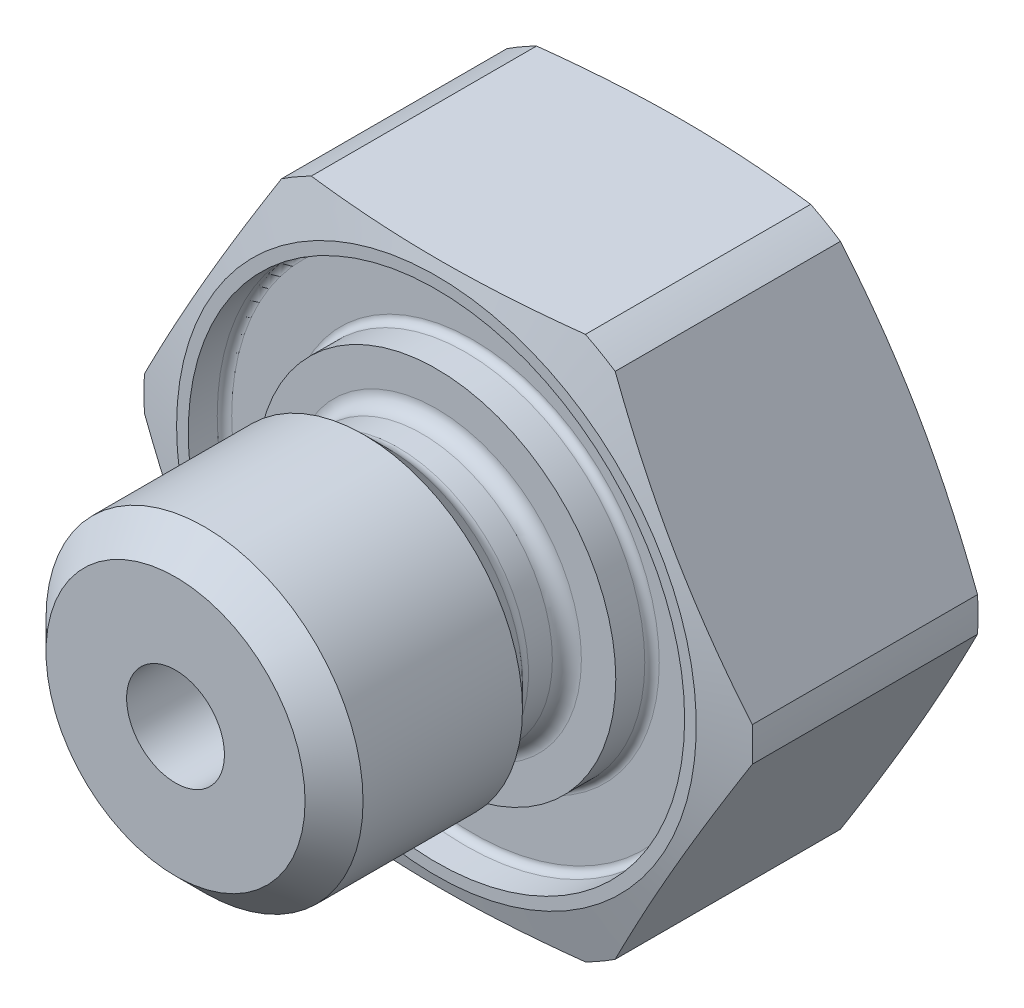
ISO-10303-21;
HEADER;
FILE_DESCRIPTION(('STEP AP214'),'2;1');
FILE_NAME('part.step','',(''),(''),'','','');
FILE_SCHEMA(('AUTOMOTIVE_DESIGN { 1 0 10303 214 1 1 1 1 }'));
ENDSEC;
DATA;
#1=APPLICATION_CONTEXT('core data for automotive mechanical design processes');
#2=APPLICATION_PROTOCOL_DEFINITION('international standard','automotive_design',2000,#1);
#3=PRODUCT_CONTEXT('',#1,'mechanical');
#4=PRODUCT('Part','Part','',(#3));
#5=PRODUCT_RELATED_PRODUCT_CATEGORY('part','',(#4));
#6=PRODUCT_DEFINITION_FORMATION('','',#4);
#7=PRODUCT_DEFINITION_CONTEXT('part definition',#1,'design');
#8=PRODUCT_DEFINITION('design','',#6,#7);
#9=PRODUCT_DEFINITION_SHAPE('','',#8);
#10=(LENGTH_UNIT() NAMED_UNIT(*) SI_UNIT(.MILLI.,.METRE.));
#11=(NAMED_UNIT(*) PLANE_ANGLE_UNIT() SI_UNIT($,.RADIAN.));
#12=(NAMED_UNIT(*) SI_UNIT($,.STERADIAN.) SOLID_ANGLE_UNIT());
#13=UNCERTAINTY_MEASURE_WITH_UNIT(LENGTH_MEASURE(1.E-05),#10,'distance_accuracy_value','');
#14=(GEOMETRIC_REPRESENTATION_CONTEXT(3) GLOBAL_UNCERTAINTY_ASSIGNED_CONTEXT((#13)) GLOBAL_UNIT_ASSIGNED_CONTEXT((#10,
#11,#12)) REPRESENTATION_CONTEXT('',''));
#15=CARTESIAN_POINT('',(0.,0.,0.));
#16=DIRECTION('',(0.,0.,1.));
#17=DIRECTION('',(1.,0.,0.));
#18=AXIS2_PLACEMENT_3D('',#15,#16,#17);
#19=CARTESIAN_POINT('',(0.,0.,-4.365625));
#20=DIRECTION('',(0.,0.,-1.));
#21=DIRECTION('',(-1.,0.,0.));
#22=AXIS2_PLACEMENT_3D('',#19,#20,#21);
#23=CONICAL_SURFACE('',#22,25.4,1.30899693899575);
#24=CARTESIAN_POINT('',(0.,0.,0.));
#25=DIRECTION('',(0.,0.,-1.));
#26=DIRECTION('',(-1.,0.,0.));
#27=AXIS2_PLACEMENT_3D('',#24,#25,#26);
#28=CIRCLE('',#27,9.1072656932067);
#29=CARTESIAN_POINT('',(-9.1072656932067,0.,0.));
#30=VERTEX_POINT('',#29);
#31=EDGE_CURVE('E275',#30,#30,#28,.T.);
#32=ORIENTED_EDGE('',*,*,#31,.T.);
#33=EDGE_LOOP('',(#32));
#34=FACE_BOUND('',#33,.T.);
#35=CARTESIAN_POINT('',(-5.49914584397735,-9.5252,-0.50679170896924));
#36=CARTESIAN_POINT('',(-5.72752592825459,-9.12963409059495,-0.445572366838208));
#37=CARTESIAN_POINT('',(-5.95632008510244,-8.73335098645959,-0.389995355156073));
#38=CARTESIAN_POINT('',(-6.41471638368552,-7.93938530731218,-0.292351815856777));
#39=CARTESIAN_POINT('',(-6.64431881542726,-7.54170222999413,-0.250290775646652));
#40=CARTESIAN_POINT('',(-7.10293961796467,-6.74734769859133,-0.182134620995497));
#41=CARTESIAN_POINT('',(-7.33195488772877,-6.35068161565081,-0.155958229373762));
#42=CARTESIAN_POINT('',(-7.7902774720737,-5.55684361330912,-0.120858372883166));
#43=CARTESIAN_POINT('',(-8.01958472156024,-5.15967180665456,-0.111931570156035));
#44=CARTESIAN_POINT('',(-8.47819922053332,-4.36532819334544,-0.111931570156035));
#45=CARTESIAN_POINT('',(-8.70750647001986,-3.96815638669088,-0.120858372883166));
#46=CARTESIAN_POINT('',(-9.16582905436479,-3.17431838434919,-0.155958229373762));
#47=CARTESIAN_POINT('',(-9.3948443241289,-2.77765230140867,-0.182134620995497));
#48=CARTESIAN_POINT('',(-9.8534651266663,-1.98329777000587,-0.250290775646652));
#49=CARTESIAN_POINT('',(-10.083067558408,-1.58561469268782,-0.292351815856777));
#50=CARTESIAN_POINT('',(-10.5414638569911,-0.791649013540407,-0.389995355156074));
#51=CARTESIAN_POINT('',(-10.770258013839,-0.395365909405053,-0.445572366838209));
#52=CARTESIAN_POINT('',(-10.9986380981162,0.000200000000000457,-0.50679170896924));
#53=B_SPLINE_CURVE_WITH_KNOTS('',3,(#35,#36,#37,#38,#39,#40,#41,#42,#43,#44,#45,#46,#47,#48,#49,
#50,#51,#52),.UNSPECIFIED.,.F.,.F.,(4,2,2,2,2,2,2,2,4),(0.,1.38260595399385,2.7657725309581,
4.14180081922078,5.51756281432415,6.89332480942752,8.2693530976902,9.65251967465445,
11.0351256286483),.UNSPECIFIED.);
#54=CARTESIAN_POINT('',(-5.84677837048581,-8.92308280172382,-0.418197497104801));
#55=VERTEX_POINT('',#54);
#56=CARTESIAN_POINT('',(-10.6510055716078,-0.601917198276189,-0.418197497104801));
#57=VERTEX_POINT('',#56);
#58=EDGE_CURVE('E280',#55,#57,#53,.T.);
#59=ORIENTED_EDGE('',*,*,#58,.F.);
#60=CARTESIAN_POINT('',(0.,0.,-0.4181974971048));
#61=DIRECTION('',(0.,0.,-1.));
#62=DIRECTION('',(-1.,0.,0.));
#63=AXIS2_PLACEMENT_3D('',#60,#61,#62);
#64=CIRCLE('',#63,10.668);
#65=CARTESIAN_POINT('',(-4.80422720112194,-9.525,-0.418197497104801));
#66=VERTEX_POINT('',#65);
#67=EDGE_CURVE('E282',#55,#66,#64,.F.);
#68=ORIENTED_EDGE('',*,*,#67,.T.);
#69=CARTESIAN_POINT('',(-14.8106950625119,-9.525,-2.27807417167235));
#70=CARTESIAN_POINT('',(-14.3755624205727,-9.525,-2.18003538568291));
#71=CARTESIAN_POINT('',(-13.9401648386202,-9.525,-2.08315217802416));
#72=CARTESIAN_POINT('',(-13.0687091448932,-9.525,-1.89232100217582));
#73=CARTESIAN_POINT('',(-12.6326510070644,-9.525,-1.79837315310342));
#74=CARTESIAN_POINT('',(-11.7593883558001,-9.525,-1.61396237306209));
#75=CARTESIAN_POINT('',(-11.3221831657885,-9.525,-1.52350263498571));
#76=CARTESIAN_POINT('',(-10.4468819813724,-9.525,-1.34700290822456));
#77=CARTESIAN_POINT('',(-10.0087859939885,-9.525,-1.26096288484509));
#78=CARTESIAN_POINT('',(-9.13492297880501,-9.525,-1.09500193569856));
#79=CARTESIAN_POINT('',(-8.69916396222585,-9.525,-1.01503902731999));
#80=CARTESIAN_POINT('',(-7.82646150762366,-9.525,-0.861807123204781));
#81=CARTESIAN_POINT('',(-7.38951806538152,-9.525,-0.788538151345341));
#82=CARTESIAN_POINT('',(-6.51434811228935,-9.525,-0.650291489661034));
#83=CARTESIAN_POINT('',(-6.07612171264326,-9.525,-0.585313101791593));
#84=CARTESIAN_POINT('',(-5.19826681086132,-9.525,-0.465512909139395));
#85=CARTESIAN_POINT('',(-4.75863830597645,-9.525,-0.41069112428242));
#86=CARTESIAN_POINT('',(-3.87292217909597,-9.525,-0.312699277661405));
#87=CARTESIAN_POINT('',(-3.42681861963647,-9.525,-0.269671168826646));
#88=CARTESIAN_POINT('',(-2.53343439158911,-9.525,-0.19819700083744));
#89=CARTESIAN_POINT('',(-2.08615375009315,-9.525,-0.169750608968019));
#90=CARTESIAN_POINT('',(-1.19106877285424,-9.525,-0.129095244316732));
#91=CARTESIAN_POINT('',(-0.743264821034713,-9.525,-0.116877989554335));
#92=CARTESIAN_POINT('',(0.152485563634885,-9.525,-0.109439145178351));
#93=CARTESIAN_POINT('',(0.600431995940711,-9.525,-0.114217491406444));
#94=CARTESIAN_POINT('',(1.49742420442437,-9.525,-0.140503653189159));
#95=CARTESIAN_POINT('',(1.94646819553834,-9.525,-0.162071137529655));
#96=CARTESIAN_POINT('',(2.84353610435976,-9.525,-0.220680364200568));
#97=CARTESIAN_POINT('',(3.29155999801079,-9.525,-0.257722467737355));
#98=CARTESIAN_POINT('',(4.18657413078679,-9.525,-0.34534615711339));
#99=CARTESIAN_POINT('',(4.63356343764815,-9.525,-0.395937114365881));
#100=CARTESIAN_POINT('',(5.52609403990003,-9.525,-0.508473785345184));
#101=CARTESIAN_POINT('',(5.97163532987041,-9.525,-0.570419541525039));
#102=CARTESIAN_POINT('',(6.83735986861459,-9.525,-0.700021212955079));
#103=CARTESIAN_POINT('',(7.25761679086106,-9.525,-0.767190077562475));
#104=CARTESIAN_POINT('',(8.09699245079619,-9.525,-0.908331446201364));
#105=CARTESIAN_POINT('',(8.51611115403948,-9.525,-0.982304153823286));
#106=CARTESIAN_POINT('',(9.35337559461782,-9.525,-1.13578875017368));
#107=CARTESIAN_POINT('',(9.7715212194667,-9.525,-1.21530124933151));
#108=CARTESIAN_POINT('',(10.6069242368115,-9.525,-1.3788247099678));
#109=CARTESIAN_POINT('',(11.0241816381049,-9.525,-1.4628356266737));
#110=CARTESIAN_POINT('',(11.8580524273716,-9.525,-1.63455092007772));
#111=CARTESIAN_POINT('',(12.2746656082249,-9.525,-1.72225629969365));
#112=CARTESIAN_POINT('',(13.1072462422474,-9.525,-1.90068471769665));
#113=CARTESIAN_POINT('',(13.5232136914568,-9.525,-1.99140777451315));
#114=CARTESIAN_POINT('',(14.7702336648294,-9.525,-2.26727318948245));
#115=CARTESIAN_POINT('',(15.6004652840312,-9.525,-2.45612462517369));
#116=CARTESIAN_POINT('',(17.2514750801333,-9.525,-2.83885982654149));
#117=CARTESIAN_POINT('',(18.0722683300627,-9.525,-3.03267900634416));
#118=CARTESIAN_POINT('',(19.7127081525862,-9.525,-3.4251731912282));
#119=CARTESIAN_POINT('',(20.5323547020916,-9.525,-3.62384829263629));
#120=CARTESIAN_POINT('',(22.1696784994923,-9.525,-4.02451030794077));
#121=CARTESIAN_POINT('',(22.9873569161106,-9.525,-4.22649245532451));
#122=CARTESIAN_POINT('',(24.2133551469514,-9.525,-4.53149031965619));
#123=CARTESIAN_POINT('',(24.6219277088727,-9.525,-4.63349196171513));
#124=CARTESIAN_POINT('',(25.4389228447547,-9.525,-4.83809237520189));
#125=CARTESIAN_POINT('',(25.8473454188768,-9.525,-4.94069114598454));
#126=CARTESIAN_POINT('',(26.255702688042,-9.525,-5.04354916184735));
#127=B_SPLINE_CURVE_WITH_KNOTS('',3,(#69,#70,#71,#72,#73,#74,#75,#76,#77,#78,#79,#80,#81,#82,
#83,#84,#85,#86,#87,#88,#89,#90,#91,#92,#93,#94,#95,#96,#97,#98,#99,#100,#101,#102,#103,#104,
#105,#106,#107,#108,#109,#110,#111,#112,#113,#114,#115,#116,#117,#118,#119,#120,#121,#122,#123,
#124,#125,#126),.UNSPECIFIED.,.F.,.F.,(4,2,2,2,2,2,2,2,2,2,2,2,2,2,2,2,2,2,2,2,2,2,2,2,2,2,2,2,
4),(0.,1.33812625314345,2.67630673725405,4.01568439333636,5.35505153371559,6.68411480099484,
8.01318280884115,9.34213883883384,10.6710974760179,12.0154119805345,13.3596958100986,
14.7032933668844,16.0468858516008,17.3952754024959,18.7436964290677,20.0930525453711,
21.4424137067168,22.7191197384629,23.9958639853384,25.2727491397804,26.5496215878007,
27.8268429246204,29.1040720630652,31.6583419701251,34.1884249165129,36.7185580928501,
39.245319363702,40.5086569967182,41.7719932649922),.UNSPECIFIED.);
#128=CARTESIAN_POINT('',(4.80422720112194,-9.525,-0.418197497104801));
#129=VERTEX_POINT('',#128);
#130=EDGE_CURVE('E217',#129,#66,#127,.F.);
#131=ORIENTED_EDGE('',*,*,#130,.F.);
#132=CARTESIAN_POINT('',(5.84677837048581,-8.92308280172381,-0.418197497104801));
#133=VERTEX_POINT('',#132);
#134=EDGE_CURVE('E410',#129,#133,#64,.F.);
#135=ORIENTED_EDGE('',*,*,#134,.T.);
#136=CARTESIAN_POINT('',(10.9986380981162,0.0002,-0.50679170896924));
#137=CARTESIAN_POINT('',(10.770258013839,-0.395365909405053,-0.44557236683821));
#138=CARTESIAN_POINT('',(10.5414638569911,-0.791649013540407,-0.389995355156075));
#139=CARTESIAN_POINT('',(10.083067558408,-1.58561469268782,-0.292351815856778));
#140=CARTESIAN_POINT('',(9.8534651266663,-1.98329777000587,-0.250290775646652));
#141=CARTESIAN_POINT('',(9.3948443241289,-2.77765230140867,-0.182134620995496));
#142=CARTESIAN_POINT('',(9.16582905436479,-3.17431838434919,-0.155958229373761));
#143=CARTESIAN_POINT('',(8.70750647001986,-3.96815638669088,-0.120858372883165));
#144=CARTESIAN_POINT('',(8.47819922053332,-4.36532819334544,-0.111931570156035));
#145=CARTESIAN_POINT('',(8.01958472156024,-5.15967180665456,-0.111931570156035));
#146=CARTESIAN_POINT('',(7.7902774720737,-5.55684361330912,-0.120858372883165));
#147=CARTESIAN_POINT('',(7.33195488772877,-6.35068161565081,-0.155958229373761));
#148=CARTESIAN_POINT('',(7.10293961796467,-6.74734769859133,-0.182134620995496));
#149=CARTESIAN_POINT('',(6.64431881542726,-7.54170222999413,-0.250290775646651));
#150=CARTESIAN_POINT('',(6.41471638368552,-7.93938530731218,-0.292351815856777));
#151=CARTESIAN_POINT('',(5.95632008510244,-8.73335098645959,-0.389995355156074));
#152=CARTESIAN_POINT('',(5.72752592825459,-9.12963409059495,-0.445572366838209));
#153=CARTESIAN_POINT('',(5.49914584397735,-9.5252,-0.50679170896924));
#154=B_SPLINE_CURVE_WITH_KNOTS('',3,(#136,#137,#138,#139,#140,#141,#142,#143,#144,#145,#146,
#147,#148,#149,#150,#151,#152,#153),.UNSPECIFIED.,.F.,.F.,(4,2,2,2,2,2,2,2,4),(0.,
1.38260595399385,2.7657725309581,4.14180081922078,5.51756281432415,6.89332480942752,
8.26935309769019,9.65251967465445,11.0351256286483),.UNSPECIFIED.);
#155=CARTESIAN_POINT('',(10.6510055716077,-0.601917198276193,-0.418197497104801));
#156=VERTEX_POINT('',#155);
#157=EDGE_CURVE('E223',#156,#133,#154,.T.);
#158=ORIENTED_EDGE('',*,*,#157,.F.);
#159=CARTESIAN_POINT('',(10.6510055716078,0.601917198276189,-0.418197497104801));
#160=VERTEX_POINT('',#159);
#161=EDGE_CURVE('E405',#156,#160,#64,.F.);
#162=ORIENTED_EDGE('',*,*,#161,.T.);
#163=CARTESIAN_POINT('',(5.49914584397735,9.5252,-0.50679170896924));
#164=CARTESIAN_POINT('',(5.72752592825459,9.12963409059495,-0.445572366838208));
#165=CARTESIAN_POINT('',(5.95632008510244,8.73335098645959,-0.389995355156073));
#166=CARTESIAN_POINT('',(6.41471638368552,7.93938530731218,-0.292351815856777));
#167=CARTESIAN_POINT('',(6.64431881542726,7.54170222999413,-0.250290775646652));
#168=CARTESIAN_POINT('',(7.10293961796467,6.74734769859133,-0.182134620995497));
#169=CARTESIAN_POINT('',(7.33195488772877,6.35068161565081,-0.155958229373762));
#170=CARTESIAN_POINT('',(7.7902774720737,5.55684361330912,-0.120858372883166));
#171=CARTESIAN_POINT('',(8.01958472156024,5.15967180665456,-0.111931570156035));
#172=CARTESIAN_POINT('',(8.47819922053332,4.36532819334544,-0.111931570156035));
#173=CARTESIAN_POINT('',(8.70750647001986,3.96815638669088,-0.120858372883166));
#174=CARTESIAN_POINT('',(9.16582905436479,3.17431838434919,-0.155958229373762));
#175=CARTESIAN_POINT('',(9.3948443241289,2.77765230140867,-0.182134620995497));
#176=CARTESIAN_POINT('',(9.8534651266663,1.98329777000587,-0.250290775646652));
#177=CARTESIAN_POINT('',(10.083067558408,1.58561469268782,-0.292351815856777));
#178=CARTESIAN_POINT('',(10.5414638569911,0.791649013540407,-0.389995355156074));
#179=CARTESIAN_POINT('',(10.770258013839,0.395365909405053,-0.445572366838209));
#180=CARTESIAN_POINT('',(10.9986380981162,-0.000200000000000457,-0.50679170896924));
#181=B_SPLINE_CURVE_WITH_KNOTS('',3,(#163,#164,#165,#166,#167,#168,#169,#170,#171,#172,#173,
#174,#175,#176,#177,#178,#179,#180),.UNSPECIFIED.,.F.,.F.,(4,2,2,2,2,2,2,2,4),(0.,
1.38260595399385,2.7657725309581,4.14180081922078,5.51756281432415,6.89332480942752,
8.2693530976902,9.65251967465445,11.0351256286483),.UNSPECIFIED.);
#182=CARTESIAN_POINT('',(5.84677837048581,8.92308280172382,-0.418197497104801));
#183=VERTEX_POINT('',#182);
#184=EDGE_CURVE('E150',#183,#160,#181,.T.);
#185=ORIENTED_EDGE('',*,*,#184,.F.);
#186=CARTESIAN_POINT('',(4.80422720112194,9.525,-0.418197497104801));
#187=VERTEX_POINT('',#186);
#188=EDGE_CURVE('E407',#183,#187,#64,.F.);
#189=ORIENTED_EDGE('',*,*,#188,.T.);
#190=CARTESIAN_POINT('',(-14.8106950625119,9.525,-2.27807417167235));
#191=CARTESIAN_POINT('',(-14.3755624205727,9.525,-2.18003538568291));
#192=CARTESIAN_POINT('',(-13.9401648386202,9.525,-2.08315217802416));
#193=CARTESIAN_POINT('',(-13.0687091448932,9.525,-1.89232100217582));
#194=CARTESIAN_POINT('',(-12.6326510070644,9.525,-1.79837315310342));
#195=CARTESIAN_POINT('',(-11.7593883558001,9.525,-1.61396237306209));
#196=CARTESIAN_POINT('',(-11.3221831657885,9.525,-1.52350263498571));
#197=CARTESIAN_POINT('',(-10.4468819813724,9.525,-1.34700290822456));
#198=CARTESIAN_POINT('',(-10.0087859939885,9.525,-1.26096288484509));
#199=CARTESIAN_POINT('',(-9.134922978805,9.525,-1.09500193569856));
#200=CARTESIAN_POINT('',(-8.69916396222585,9.525,-1.01503902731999));
#201=CARTESIAN_POINT('',(-7.82646150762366,9.525,-0.861807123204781));
#202=CARTESIAN_POINT('',(-7.38951806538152,9.525,-0.78853815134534));
#203=CARTESIAN_POINT('',(-6.51434811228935,9.525,-0.650291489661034));
#204=CARTESIAN_POINT('',(-6.07612171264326,9.525,-0.585313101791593));
#205=CARTESIAN_POINT('',(-5.19826681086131,9.525,-0.465512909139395));
#206=CARTESIAN_POINT('',(-4.75863830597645,9.525,-0.41069112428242));
#207=CARTESIAN_POINT('',(-3.87292217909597,9.525,-0.312699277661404));
#208=CARTESIAN_POINT('',(-3.42681861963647,9.525,-0.269671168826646));
#209=CARTESIAN_POINT('',(-2.53343439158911,9.525,-0.198197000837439));
#210=CARTESIAN_POINT('',(-2.08615375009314,9.525,-0.169750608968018));
#211=CARTESIAN_POINT('',(-1.19106877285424,9.525,-0.129095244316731));
#212=CARTESIAN_POINT('',(-0.743264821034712,9.525,-0.116877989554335));
#213=CARTESIAN_POINT('',(0.152485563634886,9.525,-0.10943914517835));
#214=CARTESIAN_POINT('',(0.600431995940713,9.525,-0.114217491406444));
#215=CARTESIAN_POINT('',(1.49742420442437,9.525,-0.140503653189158));
#216=CARTESIAN_POINT('',(1.94646819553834,9.525,-0.162071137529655));
#217=CARTESIAN_POINT('',(2.84353610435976,9.525,-0.220680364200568));
#218=CARTESIAN_POINT('',(3.29155999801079,9.525,-0.257722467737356));
#219=CARTESIAN_POINT('',(4.18657413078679,9.525,-0.34534615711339));
#220=CARTESIAN_POINT('',(4.63356343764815,9.525,-0.395937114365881));
#221=CARTESIAN_POINT('',(5.52609403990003,9.525,-0.508473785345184));
#222=CARTESIAN_POINT('',(5.97163532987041,9.525,-0.570419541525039));
#223=CARTESIAN_POINT('',(6.83735986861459,9.525,-0.700021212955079));
#224=CARTESIAN_POINT('',(7.25761679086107,9.525,-0.767190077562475));
#225=CARTESIAN_POINT('',(8.09699245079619,9.525,-0.908331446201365));
#226=CARTESIAN_POINT('',(8.51611115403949,9.525,-0.982304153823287));
#227=CARTESIAN_POINT('',(9.35337559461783,9.525,-1.13578875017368));
#228=CARTESIAN_POINT('',(9.7715212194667,9.525,-1.21530124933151));
#229=CARTESIAN_POINT('',(10.6069242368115,9.525,-1.3788247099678));
#230=CARTESIAN_POINT('',(11.0241816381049,9.525,-1.4628356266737));
#231=CARTESIAN_POINT('',(11.8580524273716,9.525,-1.63455092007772));
#232=CARTESIAN_POINT('',(12.2746656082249,9.525,-1.72225629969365));
#233=CARTESIAN_POINT('',(13.1072462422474,9.525,-1.90068471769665));
#234=CARTESIAN_POINT('',(13.5232136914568,9.525,-1.99140777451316));
#235=CARTESIAN_POINT('',(14.7702336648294,9.525,-2.26727318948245));
#236=CARTESIAN_POINT('',(15.6004652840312,9.525,-2.4561246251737));
#237=CARTESIAN_POINT('',(17.2514750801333,9.525,-2.83885982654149));
#238=CARTESIAN_POINT('',(18.0722683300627,9.525,-3.03267900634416));
#239=CARTESIAN_POINT('',(19.7127081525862,9.525,-3.4251731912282));
#240=CARTESIAN_POINT('',(20.5323547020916,9.525,-3.62384829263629));
#241=CARTESIAN_POINT('',(22.1696784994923,9.525,-4.02451030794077));
#242=CARTESIAN_POINT('',(22.9873569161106,9.525,-4.22649245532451));
#243=CARTESIAN_POINT('',(24.2133551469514,9.525,-4.53149031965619));
#244=CARTESIAN_POINT('',(24.6219277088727,9.525,-4.63349196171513));
#245=CARTESIAN_POINT('',(25.4389228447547,9.525,-4.83809237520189));
#246=CARTESIAN_POINT('',(25.8473454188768,9.525,-4.94069114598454));
#247=CARTESIAN_POINT('',(26.255702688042,9.525,-5.04354916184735));
#248=B_SPLINE_CURVE_WITH_KNOTS('',3,(#190,#191,#192,#193,#194,#195,#196,#197,#198,#199,#200,
#201,#202,#203,#204,#205,#206,#207,#208,#209,#210,#211,#212,#213,#214,#215,#216,#217,#218,#219,
#220,#221,#222,#223,#224,#225,#226,#227,#228,#229,#230,#231,#232,#233,#234,#235,#236,#237,#238,
#239,#240,#241,#242,#243,#244,#245,#246,#247),.UNSPECIFIED.,.F.,.F.,(4,2,2,2,2,2,2,2,2,2,2,2,2,
2,2,2,2,2,2,2,2,2,2,2,2,2,2,2,4),(0.,1.33812625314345,2.67630673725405,4.01568439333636,
5.35505153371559,6.68411480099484,8.01318280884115,9.34213883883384,10.6710974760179,
12.0154119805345,13.3596958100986,14.7032933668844,16.0468858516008,17.3952754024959,
18.7436964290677,20.0930525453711,21.4424137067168,22.7191197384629,23.9958639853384,
25.2727491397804,26.5496215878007,27.8268429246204,29.1040720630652,31.6583419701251,
34.1884249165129,36.7185580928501,39.245319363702,40.5086569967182,41.7719932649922),.UNSPECIFIED.);
#249=CARTESIAN_POINT('',(-4.80422720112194,9.525,-0.418197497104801));
#250=VERTEX_POINT('',#249);
#251=EDGE_CURVE('E236',#187,#250,#248,.F.);
#252=ORIENTED_EDGE('',*,*,#251,.T.);
#253=CARTESIAN_POINT('',(-5.84677837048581,8.92308280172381,-0.418197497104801));
#254=VERTEX_POINT('',#253);
#255=EDGE_CURVE('E416',#250,#254,#64,.F.);
#256=ORIENTED_EDGE('',*,*,#255,.T.);
#257=CARTESIAN_POINT('',(-10.9986380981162,-0.0002,-0.50679170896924));
#258=CARTESIAN_POINT('',(-10.770258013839,0.395365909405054,-0.445572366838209));
#259=CARTESIAN_POINT('',(-10.5414638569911,0.791649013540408,-0.389995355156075));
#260=CARTESIAN_POINT('',(-10.083067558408,1.58561469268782,-0.292351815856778));
#261=CARTESIAN_POINT('',(-9.8534651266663,1.98329777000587,-0.250290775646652));
#262=CARTESIAN_POINT('',(-9.3948443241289,2.77765230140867,-0.182134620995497));
#263=CARTESIAN_POINT('',(-9.16582905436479,3.17431838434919,-0.155958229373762));
#264=CARTESIAN_POINT('',(-8.70750647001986,3.96815638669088,-0.120858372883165));
#265=CARTESIAN_POINT('',(-8.47819922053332,4.36532819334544,-0.111931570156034));
#266=CARTESIAN_POINT('',(-8.01958472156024,5.15967180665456,-0.111931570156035));
#267=CARTESIAN_POINT('',(-7.7902774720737,5.55684361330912,-0.120858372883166));
#268=CARTESIAN_POINT('',(-7.33195488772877,6.35068161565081,-0.155958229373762));
#269=CARTESIAN_POINT('',(-7.10293961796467,6.74734769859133,-0.182134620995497));
#270=CARTESIAN_POINT('',(-6.64431881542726,7.54170222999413,-0.250290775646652));
#271=CARTESIAN_POINT('',(-6.41471638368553,7.93938530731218,-0.292351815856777));
#272=CARTESIAN_POINT('',(-5.95632008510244,8.73335098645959,-0.389995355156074));
#273=CARTESIAN_POINT('',(-5.7275259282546,9.12963409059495,-0.445572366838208));
#274=CARTESIAN_POINT('',(-5.49914584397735,9.5252,-0.50679170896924));
#275=B_SPLINE_CURVE_WITH_KNOTS('',3,(#257,#258,#259,#260,#261,#262,#263,#264,#265,#266,#267,
#268,#269,#270,#271,#272,#273,#274),.UNSPECIFIED.,.F.,.F.,(4,2,2,2,2,2,2,2,4),(0.,
1.38260595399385,2.7657725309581,4.14180081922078,5.51756281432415,6.89332480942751,
8.26935309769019,9.65251967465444,11.0351256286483),.UNSPECIFIED.);
#276=CARTESIAN_POINT('',(-10.6510055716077,0.601917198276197,-0.418197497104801));
#277=VERTEX_POINT('',#276);
#278=EDGE_CURVE('E242',#277,#254,#275,.T.);
#279=ORIENTED_EDGE('',*,*,#278,.F.);
#280=EDGE_CURVE('E284',#277,#57,#64,.F.);
#281=ORIENTED_EDGE('',*,*,#280,.T.);
#282=EDGE_LOOP('',(#59,#68,#131,#135,#158,#162,#185,#189,#252,#256,#279,#281));
#283=FACE_BOUND('',#282,.T.);
#284=ADVANCED_FACE('F42',(#34,#283),#23,.T.);
#285=CARTESIAN_POINT('',(-10.9985226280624,0.,-8.73125));
#286=DIRECTION('',(-0.866025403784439,-0.5,0.));
#287=DIRECTION('',(0.5,-0.866025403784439,0.));
#288=AXIS2_PLACEMENT_3D('',#285,#286,#287);
#289=PLANE('',#288);
#290=ORIENTED_EDGE('',*,*,#58,.T.);
#291=DIRECTION('',(0.,0.,-1.));
#292=VECTOR('',#291,1.);
#293=CARTESIAN_POINT('',(-10.6510055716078,-0.601917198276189,1.26875));
#294=LINE('',#293,#292);
#295=CARTESIAN_POINT('',(-10.6510055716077,-0.601917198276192,-8.31305250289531));
#296=VERTEX_POINT('',#295);
#297=EDGE_CURVE('E386',#57,#296,#294,.T.);
#298=ORIENTED_EDGE('',*,*,#297,.T.);
#299=CARTESIAN_POINT('',(-10.9986380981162,0.0002,-8.22445829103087));
#300=CARTESIAN_POINT('',(-10.770258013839,-0.395365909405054,-8.2856776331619));
#301=CARTESIAN_POINT('',(-10.5414638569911,-0.791649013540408,-8.34125464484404));
#302=CARTESIAN_POINT('',(-10.083067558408,-1.58561469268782,-8.43889818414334));
#303=CARTESIAN_POINT('',(-9.8534651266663,-1.98329777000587,-8.48095922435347));
#304=CARTESIAN_POINT('',(-9.3948443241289,-2.77765230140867,-8.54911537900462));
#305=CARTESIAN_POINT('',(-9.16582905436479,-3.17431838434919,-8.57529177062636));
#306=CARTESIAN_POINT('',(-8.70750647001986,-3.96815638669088,-8.61039162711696));
#307=CARTESIAN_POINT('',(-8.47819922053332,-4.36532819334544,-8.61931842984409));
#308=CARTESIAN_POINT('',(-8.01958472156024,-5.15967180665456,-8.61931842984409));
#309=CARTESIAN_POINT('',(-7.7902774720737,-5.55684361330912,-8.61039162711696));
#310=CARTESIAN_POINT('',(-7.33195488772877,-6.35068161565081,-8.57529177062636));
#311=CARTESIAN_POINT('',(-7.10293961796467,-6.74734769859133,-8.54911537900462));
#312=CARTESIAN_POINT('',(-6.64431881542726,-7.54170222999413,-8.48095922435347));
#313=CARTESIAN_POINT('',(-6.41471638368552,-7.93938530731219,-8.43889818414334));
#314=CARTESIAN_POINT('',(-5.95632008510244,-8.7333509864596,-8.34125464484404));
#315=CARTESIAN_POINT('',(-5.72752592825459,-9.12963409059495,-8.2856776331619));
#316=CARTESIAN_POINT('',(-5.49914584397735,-9.5252,-8.22445829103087));
#317=B_SPLINE_CURVE_WITH_KNOTS('',3,(#299,#300,#301,#302,#303,#304,#305,#306,#307,#308,#309,
#310,#311,#312,#313,#314,#315,#316),.UNSPECIFIED.,.F.,.F.,(4,2,2,2,2,2,2,2,4),(0.,
1.38260595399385,2.7657725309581,4.14180081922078,5.51756281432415,6.89332480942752,
8.2693530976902,9.65251967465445,11.0351256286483),.UNSPECIFIED.);
#318=CARTESIAN_POINT('',(-5.84677837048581,-8.92308280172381,-8.31305250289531));
#319=VERTEX_POINT('',#318);
#320=EDGE_CURVE('E192',#296,#319,#317,.T.);
#321=ORIENTED_EDGE('',*,*,#320,.T.);
#322=DIRECTION('',(0.,0.,-1.));
#323=VECTOR('',#322,1.);
#324=CARTESIAN_POINT('',(-5.84677837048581,-8.92308280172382,1.26875));
#325=LINE('',#324,#323);
#326=EDGE_CURVE('E66',#319,#55,#325,.F.);
#327=ORIENTED_EDGE('',*,*,#326,.T.);
#328=EDGE_LOOP('',(#290,#298,#321,#327));
#329=FACE_BOUND('',#328,.T.);
#330=ADVANCED_FACE('F210',(#329),#289,.T.);
#331=CARTESIAN_POINT('',(-5.49926131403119,-9.525,-8.73125));
#332=DIRECTION('',(0.,-1.,0.));
#333=DIRECTION('',(0.,0.,-1.));
#334=AXIS2_PLACEMENT_3D('',#331,#332,#333);
#335=PLANE('',#334);
#336=ORIENTED_EDGE('',*,*,#130,.T.);
#337=DIRECTION('',(0.,0.,-1.));
#338=VECTOR('',#337,1.);
#339=CARTESIAN_POINT('',(-4.80422720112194,-9.525,1.26875));
#340=LINE('',#339,#338);
#341=CARTESIAN_POINT('',(-4.80422720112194,-9.525,-8.31305250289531));
#342=VERTEX_POINT('',#341);
#343=EDGE_CURVE('E419',#66,#342,#340,.T.);
#344=ORIENTED_EDGE('',*,*,#343,.T.);
#345=CARTESIAN_POINT('',(-14.8106950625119,-9.525,-6.4531758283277));
#346=CARTESIAN_POINT('',(-14.3755624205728,-9.525,-6.55121461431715));
#347=CARTESIAN_POINT('',(-13.9401648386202,-9.525,-6.64809782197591));
#348=CARTESIAN_POINT('',(-13.0687091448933,-9.525,-6.83892899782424));
#349=CARTESIAN_POINT('',(-12.6326510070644,-9.525,-6.93287684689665));
#350=CARTESIAN_POINT('',(-11.7593883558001,-9.525,-7.11728762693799));
#351=CARTESIAN_POINT('',(-11.3221831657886,-9.525,-7.20774736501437));
#352=CARTESIAN_POINT('',(-10.4468819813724,-9.525,-7.38424709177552));
#353=CARTESIAN_POINT('',(-10.0087859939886,-9.525,-7.470287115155));
#354=CARTESIAN_POINT('',(-9.13492297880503,-9.525,-7.63624806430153));
#355=CARTESIAN_POINT('',(-8.69916396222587,-9.525,-7.71621097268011));
#356=CARTESIAN_POINT('',(-7.82646150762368,-9.525,-7.86944287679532));
#357=CARTESIAN_POINT('',(-7.38951806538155,-9.525,-7.94271184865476));
#358=CARTESIAN_POINT('',(-6.51434811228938,-9.525,-8.08095851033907));
#359=CARTESIAN_POINT('',(-6.07612171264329,-9.525,-8.14593689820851));
#360=CARTESIAN_POINT('',(-5.19826681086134,-9.525,-8.26573709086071));
#361=CARTESIAN_POINT('',(-4.75863830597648,-9.525,-8.32055887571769));
#362=CARTESIAN_POINT('',(-3.87292217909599,-9.525,-8.41855072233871));
#363=CARTESIAN_POINT('',(-3.42681861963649,-9.525,-8.46157883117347));
#364=CARTESIAN_POINT('',(-2.53343439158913,-9.525,-8.53305299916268));
#365=CARTESIAN_POINT('',(-2.08615375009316,-9.525,-8.5614993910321));
#366=CARTESIAN_POINT('',(-1.19106877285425,-9.525,-8.60215475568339));
#367=CARTESIAN_POINT('',(-0.743264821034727,-9.525,-8.61437201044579));
#368=CARTESIAN_POINT('',(0.152485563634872,-9.525,-8.62181085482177));
#369=CARTESIAN_POINT('',(0.6004319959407,-9.525,-8.61703250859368));
#370=CARTESIAN_POINT('',(1.49742420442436,-9.525,-8.59074634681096));
#371=CARTESIAN_POINT('',(1.94646819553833,-9.525,-8.56917886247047));
#372=CARTESIAN_POINT('',(2.84353610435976,-9.525,-8.51056963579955));
#373=CARTESIAN_POINT('',(3.29155999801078,-9.525,-8.47352753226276));
#374=CARTESIAN_POINT('',(4.18657413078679,-9.525,-8.38590384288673));
#375=CARTESIAN_POINT('',(4.63356343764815,-9.525,-8.33531288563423));
#376=CARTESIAN_POINT('',(5.52609403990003,-9.525,-8.22277621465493));
#377=CARTESIAN_POINT('',(5.97163532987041,-9.525,-8.16083045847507));
#378=CARTESIAN_POINT('',(6.83735986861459,-9.525,-8.03122878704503));
#379=CARTESIAN_POINT('',(7.25761679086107,-9.525,-7.96405992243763));
#380=CARTESIAN_POINT('',(8.09699245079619,-9.525,-7.82291855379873));
#381=CARTESIAN_POINT('',(8.51611115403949,-9.525,-7.74894584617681));
#382=CARTESIAN_POINT('',(9.35337559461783,-9.525,-7.59546124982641));
#383=CARTESIAN_POINT('',(9.7715212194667,-9.525,-7.51594875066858));
#384=CARTESIAN_POINT('',(10.6069242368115,-9.525,-7.35242529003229));
#385=CARTESIAN_POINT('',(11.0241816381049,-9.525,-7.26841437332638));
#386=CARTESIAN_POINT('',(11.8580524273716,-9.525,-7.09669907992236));
#387=CARTESIAN_POINT('',(12.2746656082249,-9.525,-7.00899370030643));
#388=CARTESIAN_POINT('',(13.1072462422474,-9.525,-6.83056528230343));
#389=CARTESIAN_POINT('',(13.5232136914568,-9.525,-6.73984222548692));
#390=CARTESIAN_POINT('',(14.7702336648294,-9.525,-6.46397681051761));
#391=CARTESIAN_POINT('',(15.6004652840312,-9.525,-6.27512537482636));
#392=CARTESIAN_POINT('',(17.2514750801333,-9.525,-5.89239017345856));
#393=CARTESIAN_POINT('',(18.0722683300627,-9.525,-5.69857099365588));
#394=CARTESIAN_POINT('',(19.7127081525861,-9.525,-5.30607680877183));
#395=CARTESIAN_POINT('',(20.5323547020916,-9.525,-5.10740170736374));
#396=CARTESIAN_POINT('',(22.1696784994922,-9.525,-4.70673969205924));
#397=CARTESIAN_POINT('',(22.9873569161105,-9.525,-4.5047575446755));
#398=CARTESIAN_POINT('',(24.2133551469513,-9.525,-4.19975968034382));
#399=CARTESIAN_POINT('',(24.6219277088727,-9.525,-4.09775803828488));
#400=CARTESIAN_POINT('',(25.4389228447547,-9.525,-3.89315762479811));
#401=CARTESIAN_POINT('',(25.8473454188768,-9.525,-3.79055885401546));
#402=CARTESIAN_POINT('',(26.2557026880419,-9.525,-3.68770083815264));
#403=B_SPLINE_CURVE_WITH_KNOTS('',3,(#345,#346,#347,#348,#349,#350,#351,#352,#353,#354,#355,
#356,#357,#358,#359,#360,#361,#362,#363,#364,#365,#366,#367,#368,#369,#370,#371,#372,#373,#374,
#375,#376,#377,#378,#379,#380,#381,#382,#383,#384,#385,#386,#387,#388,#389,#390,#391,#392,#393,
#394,#395,#396,#397,#398,#399,#400,#401,#402),.UNSPECIFIED.,.F.,.F.,(4,2,2,2,2,2,2,2,2,2,2,2,2,
2,2,2,2,2,2,2,2,2,2,2,2,2,2,2,4),(0.,1.33812625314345,2.67630673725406,4.01568439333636,
5.35505153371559,6.68411480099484,8.01318280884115,9.34213883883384,10.6710974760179,
12.0154119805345,13.3596958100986,14.7032933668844,16.0468858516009,17.3952754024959,
18.7436964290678,20.0930525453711,21.4424137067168,22.719119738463,23.9958639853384,
25.2727491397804,26.5496215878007,27.8268429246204,29.1040720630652,31.6583419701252,
34.188424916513,36.7185580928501,39.245319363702,40.5086569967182,41.7719932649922),.UNSPECIFIED.);
#404=CARTESIAN_POINT('',(4.80422720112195,-9.525,-8.31305250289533));
#405=VERTEX_POINT('',#404);
#406=EDGE_CURVE('E160',#342,#405,#403,.T.);
#407=ORIENTED_EDGE('',*,*,#406,.T.);
#408=DIRECTION('',(0.,0.,-1.));
#409=VECTOR('',#408,1.);
#410=CARTESIAN_POINT('',(4.80422720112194,-9.525,1.26875));
#411=LINE('',#410,#409);
#412=EDGE_CURVE('E425',#405,#129,#411,.F.);
#413=ORIENTED_EDGE('',*,*,#412,.T.);
#414=EDGE_LOOP('',(#336,#344,#407,#413));
#415=FACE_BOUND('',#414,.T.);
#416=ADVANCED_FACE('F206',(#415),#335,.T.);
#417=CARTESIAN_POINT('',(5.49926131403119,-9.525,-8.73125));
#418=DIRECTION('',(0.866025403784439,-0.5,0.));
#419=DIRECTION('',(0.5,0.866025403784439,0.));
#420=AXIS2_PLACEMENT_3D('',#417,#418,#419);
#421=PLANE('',#420);
#422=ORIENTED_EDGE('',*,*,#157,.T.);
#423=DIRECTION('',(0.,0.,-1.));
#424=VECTOR('',#423,1.);
#425=CARTESIAN_POINT('',(5.84677837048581,-8.92308280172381,1.26875));
#426=LINE('',#425,#424);
#427=CARTESIAN_POINT('',(5.84677837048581,-8.92308280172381,-8.31305250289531));
#428=VERTEX_POINT('',#427);
#429=EDGE_CURVE('E422',#133,#428,#426,.T.);
#430=ORIENTED_EDGE('',*,*,#429,.T.);
#431=CARTESIAN_POINT('',(5.49914584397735,-9.5252,-8.22445829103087));
#432=CARTESIAN_POINT('',(5.72752592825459,-9.12963409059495,-8.2856776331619));
#433=CARTESIAN_POINT('',(5.95632008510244,-8.73335098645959,-8.34125464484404));
#434=CARTESIAN_POINT('',(6.41471638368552,-7.93938530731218,-8.43889818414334));
#435=CARTESIAN_POINT('',(6.64431881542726,-7.54170222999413,-8.48095922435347));
#436=CARTESIAN_POINT('',(7.10293961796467,-6.74734769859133,-8.54911537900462));
#437=CARTESIAN_POINT('',(7.33195488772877,-6.35068161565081,-8.57529177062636));
#438=CARTESIAN_POINT('',(7.7902774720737,-5.55684361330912,-8.61039162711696));
#439=CARTESIAN_POINT('',(8.01958472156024,-5.15967180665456,-8.61931842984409));
#440=CARTESIAN_POINT('',(8.47819922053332,-4.36532819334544,-8.61931842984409));
#441=CARTESIAN_POINT('',(8.70750647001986,-3.96815638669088,-8.61039162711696));
#442=CARTESIAN_POINT('',(9.16582905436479,-3.17431838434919,-8.57529177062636));
#443=CARTESIAN_POINT('',(9.3948443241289,-2.77765230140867,-8.54911537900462));
#444=CARTESIAN_POINT('',(9.8534651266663,-1.98329777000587,-8.48095922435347));
#445=CARTESIAN_POINT('',(10.083067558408,-1.58561469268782,-8.43889818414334));
#446=CARTESIAN_POINT('',(10.5414638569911,-0.791649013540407,-8.34125464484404));
#447=CARTESIAN_POINT('',(10.770258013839,-0.395365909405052,-8.2856776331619));
#448=CARTESIAN_POINT('',(10.9986380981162,0.00020000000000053,-8.22445829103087));
#449=B_SPLINE_CURVE_WITH_KNOTS('',3,(#431,#432,#433,#434,#435,#436,#437,#438,#439,#440,#441,
#442,#443,#444,#445,#446,#447,#448),.UNSPECIFIED.,.F.,.F.,(4,2,2,2,2,2,2,2,4),(0.,
1.38260595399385,2.76577253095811,4.14180081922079,5.51756281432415,6.89332480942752,
8.2693530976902,9.65251967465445,11.0351256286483),.UNSPECIFIED.);
#450=CARTESIAN_POINT('',(10.6510055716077,-0.601917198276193,-8.31305250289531));
#451=VERTEX_POINT('',#450);
#452=EDGE_CURVE('E156',#428,#451,#449,.T.);
#453=ORIENTED_EDGE('',*,*,#452,.T.);
#454=DIRECTION('',(0.,0.,-1.));
#455=VECTOR('',#454,1.);
#456=CARTESIAN_POINT('',(10.6510055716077,-0.601917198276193,1.26875));
#457=LINE('',#456,#455);
#458=EDGE_CURVE('E136',#451,#156,#457,.F.);
#459=ORIENTED_EDGE('',*,*,#458,.T.);
#460=EDGE_LOOP('',(#422,#430,#453,#459));
#461=FACE_BOUND('',#460,.T.);
#462=ADVANCED_FACE('F209',(#461),#421,.T.);
#463=CARTESIAN_POINT('',(10.9985226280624,0.,-8.73125));
#464=DIRECTION('',(0.866025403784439,0.5,0.));
#465=DIRECTION('',(-0.5,0.866025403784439,0.));
#466=AXIS2_PLACEMENT_3D('',#463,#464,#465);
#467=PLANE('',#466);
#468=ORIENTED_EDGE('',*,*,#184,.T.);
#469=DIRECTION('',(0.,0.,-1.));
#470=VECTOR('',#469,1.);
#471=CARTESIAN_POINT('',(10.6510055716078,0.601917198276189,1.26875));
#472=LINE('',#471,#470);
#473=CARTESIAN_POINT('',(10.6510055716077,0.601917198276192,-8.31305250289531));
#474=VERTEX_POINT('',#473);
#475=EDGE_CURVE('E133',#160,#474,#472,.T.);
#476=ORIENTED_EDGE('',*,*,#475,.T.);
#477=CARTESIAN_POINT('',(10.9986380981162,-0.0002,-8.22445829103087));
#478=CARTESIAN_POINT('',(10.770258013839,0.395365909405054,-8.2856776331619));
#479=CARTESIAN_POINT('',(10.5414638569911,0.791649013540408,-8.34125464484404));
#480=CARTESIAN_POINT('',(10.083067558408,1.58561469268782,-8.43889818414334));
#481=CARTESIAN_POINT('',(9.8534651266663,1.98329777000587,-8.48095922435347));
#482=CARTESIAN_POINT('',(9.3948443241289,2.77765230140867,-8.54911537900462));
#483=CARTESIAN_POINT('',(9.16582905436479,3.17431838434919,-8.57529177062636));
#484=CARTESIAN_POINT('',(8.70750647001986,3.96815638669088,-8.61039162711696));
#485=CARTESIAN_POINT('',(8.47819922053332,4.36532819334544,-8.61931842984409));
#486=CARTESIAN_POINT('',(8.01958472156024,5.15967180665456,-8.61931842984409));
#487=CARTESIAN_POINT('',(7.7902774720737,5.55684361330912,-8.61039162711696));
#488=CARTESIAN_POINT('',(7.33195488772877,6.35068161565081,-8.57529177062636));
#489=CARTESIAN_POINT('',(7.10293961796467,6.74734769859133,-8.54911537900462));
#490=CARTESIAN_POINT('',(6.64431881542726,7.54170222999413,-8.48095922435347));
#491=CARTESIAN_POINT('',(6.41471638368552,7.93938530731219,-8.43889818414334));
#492=CARTESIAN_POINT('',(5.95632008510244,8.7333509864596,-8.34125464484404));
#493=CARTESIAN_POINT('',(5.72752592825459,9.12963409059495,-8.2856776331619));
#494=CARTESIAN_POINT('',(5.49914584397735,9.5252,-8.22445829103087));
#495=B_SPLINE_CURVE_WITH_KNOTS('',3,(#477,#478,#479,#480,#481,#482,#483,#484,#485,#486,#487,
#488,#489,#490,#491,#492,#493,#494),.UNSPECIFIED.,.F.,.F.,(4,2,2,2,2,2,2,2,4),(0.,
1.38260595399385,2.7657725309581,4.14180081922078,5.51756281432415,6.89332480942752,
8.2693530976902,9.65251967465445,11.0351256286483),.UNSPECIFIED.);
#496=CARTESIAN_POINT('',(5.84677837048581,8.92308280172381,-8.31305250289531));
#497=VERTEX_POINT('',#496);
#498=EDGE_CURVE('E148',#474,#497,#495,.T.);
#499=ORIENTED_EDGE('',*,*,#498,.T.);
#500=DIRECTION('',(0.,0.,-1.));
#501=VECTOR('',#500,1.);
#502=CARTESIAN_POINT('',(5.84677837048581,8.92308280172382,1.26875));
#503=LINE('',#502,#501);
#504=EDGE_CURVE('E404',#497,#183,#503,.F.);
#505=ORIENTED_EDGE('',*,*,#504,.T.);
#506=EDGE_LOOP('',(#468,#476,#499,#505));
#507=FACE_BOUND('',#506,.T.);
#508=ADVANCED_FACE('F146',(#507),#467,.T.);
#509=CARTESIAN_POINT('',(-5.49926131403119,9.525,-8.73125));
#510=DIRECTION('',(0.,-1.,0.));
#511=DIRECTION('',(0.,0.,-1.));
#512=AXIS2_PLACEMENT_3D('',#509,#510,#511);
#513=PLANE('',#512);
#514=DIRECTION('',(0.,0.,-1.));
#515=VECTOR('',#514,1.);
#516=CARTESIAN_POINT('',(-4.80422720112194,9.525,1.26875));
#517=LINE('',#516,#515);
#518=CARTESIAN_POINT('',(-4.80422720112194,9.525,-8.31305250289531));
#519=VERTEX_POINT('',#518);
#520=EDGE_CURVE('E400',#250,#519,#517,.T.);
#521=ORIENTED_EDGE('',*,*,#520,.F.);
#522=ORIENTED_EDGE('',*,*,#251,.F.);
#523=DIRECTION('',(0.,0.,-1.));
#524=VECTOR('',#523,1.);
#525=CARTESIAN_POINT('',(4.80422720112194,9.525,1.26875));
#526=LINE('',#525,#524);
#527=CARTESIAN_POINT('',(4.80422720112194,9.525,-8.31305250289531));
#528=VERTEX_POINT('',#527);
#529=EDGE_CURVE('E401',#528,#187,#526,.F.);
#530=ORIENTED_EDGE('',*,*,#529,.F.);
#531=CARTESIAN_POINT('',(-14.8106950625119,9.525,-6.4531758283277));
#532=CARTESIAN_POINT('',(-14.3755624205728,9.525,-6.55121461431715));
#533=CARTESIAN_POINT('',(-13.9401648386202,9.525,-6.64809782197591));
#534=CARTESIAN_POINT('',(-13.0687091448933,9.525,-6.83892899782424));
#535=CARTESIAN_POINT('',(-12.6326510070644,9.525,-6.93287684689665));
#536=CARTESIAN_POINT('',(-11.7593883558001,9.525,-7.11728762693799));
#537=CARTESIAN_POINT('',(-11.3221831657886,9.525,-7.20774736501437));
#538=CARTESIAN_POINT('',(-10.4468819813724,9.525,-7.38424709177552));
#539=CARTESIAN_POINT('',(-10.0087859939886,9.525,-7.470287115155));
#540=CARTESIAN_POINT('',(-9.13492297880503,9.525,-7.63624806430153));
#541=CARTESIAN_POINT('',(-8.69916396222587,9.525,-7.71621097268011));
#542=CARTESIAN_POINT('',(-7.82646150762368,9.525,-7.86944287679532));
#543=CARTESIAN_POINT('',(-7.38951806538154,9.525,-7.94271184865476));
#544=CARTESIAN_POINT('',(-6.51434811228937,9.525,-8.08095851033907));
#545=CARTESIAN_POINT('',(-6.07612171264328,9.525,-8.14593689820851));
#546=CARTESIAN_POINT('',(-5.19826681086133,9.525,-8.26573709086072));
#547=CARTESIAN_POINT('',(-4.75863830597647,9.525,-8.32055887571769));
#548=CARTESIAN_POINT('',(-3.87292217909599,9.525,-8.41855072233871));
#549=CARTESIAN_POINT('',(-3.42681861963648,9.525,-8.46157883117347));
#550=CARTESIAN_POINT('',(-2.53343439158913,9.525,-8.53305299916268));
#551=CARTESIAN_POINT('',(-2.08615375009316,9.525,-8.5614993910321));
#552=CARTESIAN_POINT('',(-1.19106877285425,9.525,-8.60215475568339));
#553=CARTESIAN_POINT('',(-0.743264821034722,9.525,-8.61437201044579));
#554=CARTESIAN_POINT('',(0.152485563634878,9.525,-8.62181085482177));
#555=CARTESIAN_POINT('',(0.600431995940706,9.525,-8.61703250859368));
#556=CARTESIAN_POINT('',(1.49742420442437,9.525,-8.59074634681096));
#557=CARTESIAN_POINT('',(1.94646819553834,9.525,-8.56917886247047));
#558=CARTESIAN_POINT('',(2.84353610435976,9.525,-8.51056963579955));
#559=CARTESIAN_POINT('',(3.29155999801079,9.525,-8.47352753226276));
#560=CARTESIAN_POINT('',(4.1865741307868,9.525,-8.38590384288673));
#561=CARTESIAN_POINT('',(4.63356343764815,9.525,-8.33531288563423));
#562=CARTESIAN_POINT('',(5.52609403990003,9.525,-8.22277621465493));
#563=CARTESIAN_POINT('',(5.97163532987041,9.525,-8.16083045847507));
#564=CARTESIAN_POINT('',(6.83735986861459,9.525,-8.03122878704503));
#565=CARTESIAN_POINT('',(7.25761679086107,9.525,-7.96405992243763));
#566=CARTESIAN_POINT('',(8.09699245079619,9.525,-7.82291855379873));
#567=CARTESIAN_POINT('',(8.51611115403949,9.525,-7.74894584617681));
#568=CARTESIAN_POINT('',(9.35337559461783,9.525,-7.59546124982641));
#569=CARTESIAN_POINT('',(9.7715212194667,9.525,-7.51594875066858));
#570=CARTESIAN_POINT('',(10.6069242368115,9.525,-7.35242529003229));
#571=CARTESIAN_POINT('',(11.0241816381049,9.525,-7.26841437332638));
#572=CARTESIAN_POINT('',(11.8580524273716,9.525,-7.09669907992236));
#573=CARTESIAN_POINT('',(12.2746656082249,9.525,-7.00899370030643));
#574=CARTESIAN_POINT('',(13.1072462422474,9.525,-6.83056528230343));
#575=CARTESIAN_POINT('',(13.5232136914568,9.525,-6.73984222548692));
#576=CARTESIAN_POINT('',(14.7702336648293,9.525,-6.46397681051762));
#577=CARTESIAN_POINT('',(15.6004652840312,9.525,-6.27512537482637));
#578=CARTESIAN_POINT('',(17.2514750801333,9.525,-5.89239017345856));
#579=CARTESIAN_POINT('',(18.0722683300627,9.525,-5.69857099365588));
#580=CARTESIAN_POINT('',(19.7127081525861,9.525,-5.30607680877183));
#581=CARTESIAN_POINT('',(20.5323547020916,9.525,-5.10740170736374));
#582=CARTESIAN_POINT('',(22.1696784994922,9.525,-4.70673969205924));
#583=CARTESIAN_POINT('',(22.9873569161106,9.525,-4.5047575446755));
#584=CARTESIAN_POINT('',(24.2133551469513,9.525,-4.19975968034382));
#585=CARTESIAN_POINT('',(24.6219277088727,9.525,-4.09775803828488));
#586=CARTESIAN_POINT('',(25.4389228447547,9.525,-3.89315762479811));
#587=CARTESIAN_POINT('',(25.8473454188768,9.525,-3.79055885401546));
#588=CARTESIAN_POINT('',(26.2557026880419,9.525,-3.68770083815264));
#589=B_SPLINE_CURVE_WITH_KNOTS('',3,(#531,#532,#533,#534,#535,#536,#537,#538,#539,#540,#541,
#542,#543,#544,#545,#546,#547,#548,#549,#550,#551,#552,#553,#554,#555,#556,#557,#558,#559,#560,
#561,#562,#563,#564,#565,#566,#567,#568,#569,#570,#571,#572,#573,#574,#575,#576,#577,#578,#579,
#580,#581,#582,#583,#584,#585,#586,#587,#588),.UNSPECIFIED.,.F.,.F.,(4,2,2,2,2,2,2,2,2,2,2,2,2,
2,2,2,2,2,2,2,2,2,2,2,2,2,2,2,4),(0.,1.33812625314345,2.67630673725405,4.01568439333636,
5.35505153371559,6.68411480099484,8.01318280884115,9.34213883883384,10.6710974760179,
12.0154119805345,13.3596958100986,14.7032933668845,16.0468858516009,17.3952754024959,
18.7436964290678,20.0930525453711,21.4424137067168,22.719119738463,23.9958639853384,
25.2727491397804,26.5496215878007,27.8268429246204,29.1040720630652,31.6583419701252,
34.188424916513,36.7185580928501,39.245319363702,40.5086569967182,41.7719932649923),.UNSPECIFIED.);
#590=EDGE_CURVE('E155',#519,#528,#589,.T.);
#591=ORIENTED_EDGE('',*,*,#590,.F.);
#592=EDGE_LOOP('',(#521,#522,#530,#591));
#593=FACE_BOUND('',#592,.T.);
#594=ADVANCED_FACE('F247',(#593),#513,.F.);
#595=CARTESIAN_POINT('',(-5.49926131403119,9.525,-8.73125));
#596=DIRECTION('',(-0.866025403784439,0.5,0.));
#597=DIRECTION('',(-0.5,-0.866025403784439,0.));
#598=AXIS2_PLACEMENT_3D('',#595,#596,#597);
#599=PLANE('',#598);
#600=ORIENTED_EDGE('',*,*,#278,.T.);
#601=DIRECTION('',(0.,0.,-1.));
#602=VECTOR('',#601,1.);
#603=CARTESIAN_POINT('',(-5.84677837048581,8.92308280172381,1.26875));
#604=LINE('',#603,#602);
#605=CARTESIAN_POINT('',(-5.84677837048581,8.92308280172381,-8.31305250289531));
#606=VERTEX_POINT('',#605);
#607=EDGE_CURVE('E413',#254,#606,#604,.T.);
#608=ORIENTED_EDGE('',*,*,#607,.T.);
#609=CARTESIAN_POINT('',(-5.49914584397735,9.5252,-8.22445829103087));
#610=CARTESIAN_POINT('',(-5.72752592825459,9.12963409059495,-8.2856776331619));
#611=CARTESIAN_POINT('',(-5.95632008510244,8.73335098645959,-8.34125464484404));
#612=CARTESIAN_POINT('',(-6.41471638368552,7.93938530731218,-8.43889818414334));
#613=CARTESIAN_POINT('',(-6.64431881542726,7.54170222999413,-8.48095922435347));
#614=CARTESIAN_POINT('',(-7.10293961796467,6.74734769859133,-8.54911537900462));
#615=CARTESIAN_POINT('',(-7.33195488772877,6.35068161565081,-8.57529177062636));
#616=CARTESIAN_POINT('',(-7.7902774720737,5.55684361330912,-8.61039162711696));
#617=CARTESIAN_POINT('',(-8.01958472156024,5.15967180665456,-8.61931842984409));
#618=CARTESIAN_POINT('',(-8.47819922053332,4.36532819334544,-8.61931842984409));
#619=CARTESIAN_POINT('',(-8.70750647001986,3.96815638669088,-8.61039162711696));
#620=CARTESIAN_POINT('',(-9.16582905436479,3.17431838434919,-8.57529177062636));
#621=CARTESIAN_POINT('',(-9.3948443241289,2.77765230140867,-8.54911537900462));
#622=CARTESIAN_POINT('',(-9.8534651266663,1.98329777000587,-8.48095922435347));
#623=CARTESIAN_POINT('',(-10.083067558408,1.58561469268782,-8.43889818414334));
#624=CARTESIAN_POINT('',(-10.5414638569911,0.791649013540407,-8.34125464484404));
#625=CARTESIAN_POINT('',(-10.770258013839,0.395365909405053,-8.2856776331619));
#626=CARTESIAN_POINT('',(-10.9986380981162,-0.000200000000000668,-8.22445829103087));
#627=B_SPLINE_CURVE_WITH_KNOTS('',3,(#609,#610,#611,#612,#613,#614,#615,#616,#617,#618,#619,
#620,#621,#622,#623,#624,#625,#626),.UNSPECIFIED.,.F.,.F.,(4,2,2,2,2,2,2,2,4),(0.,
1.38260595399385,2.7657725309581,4.14180081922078,5.51756281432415,6.89332480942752,
8.2693530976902,9.65251967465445,11.0351256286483),.UNSPECIFIED.);
#628=CARTESIAN_POINT('',(-10.6510055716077,0.601917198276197,-8.31305250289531));
#629=VERTEX_POINT('',#628);
#630=EDGE_CURVE('E158',#606,#629,#627,.T.);
#631=ORIENTED_EDGE('',*,*,#630,.T.);
#632=DIRECTION('',(0.,0.,-1.));
#633=VECTOR('',#632,1.);
#634=CARTESIAN_POINT('',(-10.6510055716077,0.601917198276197,1.26875));
#635=LINE('',#634,#633);
#636=EDGE_CURVE('E58',#629,#277,#635,.F.);
#637=ORIENTED_EDGE('',*,*,#636,.T.);
#638=EDGE_LOOP('',(#600,#608,#631,#637));
#639=FACE_BOUND('',#638,.T.);
#640=ADVANCED_FACE('F183',(#639),#599,.T.);
#641=CARTESIAN_POINT('',(0.,0.,-11.1715344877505));
#642=DIRECTION('',(0.,0.,1.));
#643=DIRECTION('',(1.,0.,0.));
#644=AXIS2_PLACEMENT_3D('',#641,#642,#643);
#645=CONICAL_SURFACE('',#644,0.,1.30899693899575);
#646=CARTESIAN_POINT('',(0.,0.,-8.73125));
#647=DIRECTION('',(0.,0.,1.));
#648=DIRECTION('',(1.,0.,0.));
#649=AXIS2_PLACEMENT_3D('',#646,#647,#648);
#650=CIRCLE('',#649,9.10726569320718);
#651=CARTESIAN_POINT('',(9.10726569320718,0.,-8.73125));
#652=VERTEX_POINT('',#651);
#653=EDGE_CURVE('E295',#652,#652,#650,.T.);
#654=ORIENTED_EDGE('',*,*,#653,.T.);
#655=EDGE_LOOP('',(#654));
#656=FACE_BOUND('',#655,.T.);
#657=ORIENTED_EDGE('',*,*,#452,.F.);
#658=CARTESIAN_POINT('',(0.,0.,-8.31305250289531));
#659=DIRECTION('',(0.,0.,1.));
#660=DIRECTION('',(1.,0.,0.));
#661=AXIS2_PLACEMENT_3D('',#658,#659,#660);
#662=CIRCLE('',#661,10.668);
#663=EDGE_CURVE('E11',#428,#405,#662,.F.);
#664=ORIENTED_EDGE('',*,*,#663,.T.);
#665=ORIENTED_EDGE('',*,*,#406,.F.);
#666=EDGE_CURVE('E51',#342,#319,#662,.F.);
#667=ORIENTED_EDGE('',*,*,#666,.T.);
#668=ORIENTED_EDGE('',*,*,#320,.F.);
#669=EDGE_CURVE('E388',#296,#629,#662,.F.);
#670=ORIENTED_EDGE('',*,*,#669,.T.);
#671=ORIENTED_EDGE('',*,*,#630,.F.);
#672=EDGE_CURVE('E392',#606,#519,#662,.F.);
#673=ORIENTED_EDGE('',*,*,#672,.T.);
#674=ORIENTED_EDGE('',*,*,#590,.T.);
#675=EDGE_CURVE('E141',#528,#497,#662,.F.);
#676=ORIENTED_EDGE('',*,*,#675,.T.);
#677=ORIENTED_EDGE('',*,*,#498,.F.);
#678=EDGE_CURVE('E46',#474,#451,#662,.F.);
#679=ORIENTED_EDGE('',*,*,#678,.T.);
#680=EDGE_LOOP('',(#657,#664,#665,#667,#668,#670,#671,#673,#674,#676,#677,#679));
#681=FACE_BOUND('',#680,.T.);
#682=ADVANCED_FACE('F153',(#656,#681),#645,.T.);
#683=CARTESIAN_POINT('',(-10.9985226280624,0.,0.));
#684=DIRECTION('',(0.,0.,1.));
#685=DIRECTION('',(1.,0.,0.));
#686=AXIS2_PLACEMENT_3D('',#683,#684,#685);
#687=PLANE('',#686);
#688=CARTESIAN_POINT('',(0.,0.,0.));
#689=DIRECTION('',(0.,0.,1.));
#690=DIRECTION('',(1.,0.,0.));
#691=AXIS2_PLACEMENT_3D('',#688,#689,#690);
#692=CIRCLE('',#691,8.6995);
#693=CARTESIAN_POINT('',(8.6995,0.,0.));
#694=VERTEX_POINT('',#693);
#695=EDGE_CURVE('E431',#694,#694,#692,.T.);
#696=ORIENTED_EDGE('',*,*,#695,.F.);
#697=EDGE_LOOP('',(#696));
#698=FACE_BOUND('',#697,.T.);
#699=ORIENTED_EDGE('',*,*,#31,.F.);
#700=EDGE_LOOP('',(#699));
#701=FACE_BOUND('',#700,.T.);
#702=ADVANCED_FACE('F182',(#698,#701),#687,.T.);
#703=CARTESIAN_POINT('',(0.,0.,9.144));
#704=DIRECTION('',(0.,0.,-1.));
#705=DIRECTION('',(-1.,0.,0.));
#706=AXIS2_PLACEMENT_3D('',#703,#704,#705);
#707=CYLINDRICAL_SURFACE('',#706,5.55625);
#708=CARTESIAN_POINT('',(0.,0.,8.12799999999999));
#709=DIRECTION('',(0.,0.,1.));
#710=DIRECTION('',(1.,0.,0.));
#711=AXIS2_PLACEMENT_3D('',#708,#709,#710);
#712=CIRCLE('',#711,5.55625);
#713=CARTESIAN_POINT('',(5.55625,0.,8.12799999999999));
#714=VERTEX_POINT('',#713);
#715=EDGE_CURVE('E289',#714,#714,#712,.F.);
#716=ORIENTED_EDGE('',*,*,#715,.T.);
#717=EDGE_LOOP('',(#716));
#718=FACE_BOUND('',#717,.T.);
#719=CARTESIAN_POINT('',(0.,0.,2.54));
#720=DIRECTION('',(0.,0.,-1.));
#721=DIRECTION('',(-1.,0.,0.));
#722=AXIS2_PLACEMENT_3D('',#719,#720,#721);
#723=CIRCLE('',#722,5.55625);
#724=CARTESIAN_POINT('',(-5.55625,0.,2.54));
#725=VERTEX_POINT('',#724);
#726=EDGE_CURVE('E378',#725,#725,#723,.T.);
#727=ORIENTED_EDGE('',*,*,#726,.F.);
#728=EDGE_LOOP('',(#727));
#729=FACE_BOUND('',#728,.T.);
#730=ADVANCED_FACE('F44',(#718,#729),#707,.T.);
#731=CARTESIAN_POINT('',(0.,0.,9.144));
#732=DIRECTION('',(0.,0.,1.));
#733=DIRECTION('',(1.,0.,0.));
#734=AXIS2_PLACEMENT_3D('',#731,#732,#733);
#735=PLANE('',#734);
#736=CARTESIAN_POINT('',(0.,0.,9.144));
#737=DIRECTION('',(0.,0.,1.));
#738=DIRECTION('',(1.,0.,0.));
#739=AXIS2_PLACEMENT_3D('',#736,#737,#738);
#740=CIRCLE('',#739,1.7145);
#741=CARTESIAN_POINT('',(1.7145,0.,9.144));
#742=VERTEX_POINT('',#741);
#743=EDGE_CURVE('E369',#742,#742,#740,.T.);
#744=ORIENTED_EDGE('',*,*,#743,.F.);
#745=EDGE_LOOP('',(#744));
#746=FACE_BOUND('',#745,.T.);
#747=CARTESIAN_POINT('',(0.,0.,9.144));
#748=DIRECTION('',(0.,0.,1.));
#749=DIRECTION('',(1.,0.,0.));
#750=AXIS2_PLACEMENT_3D('',#747,#748,#749);
#751=CIRCLE('',#750,4.54024999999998);
#752=CARTESIAN_POINT('',(4.54024999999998,0.,9.144));
#753=VERTEX_POINT('',#752);
#754=EDGE_CURVE('E286',#753,#753,#751,.T.);
#755=ORIENTED_EDGE('',*,*,#754,.T.);
#756=EDGE_LOOP('',(#755));
#757=FACE_BOUND('',#756,.T.);
#758=ADVANCED_FACE('F251',(#746,#757),#735,.T.);
#759=CARTESIAN_POINT('',(0.,0.,1.55575));
#760=DIRECTION('',(0.,0.,1.));
#761=DIRECTION('',(1.,0.,0.));
#762=AXIS2_PLACEMENT_3D('',#759,#760,#761);
#763=CONICAL_SURFACE('',#762,4.572,0.785398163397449);
#764=CARTESIAN_POINT('',(0.,0.,1.70453975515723));
#765=DIRECTION('',(0.,0.,1.));
#766=DIRECTION('',(1.,0.,0.));
#767=AXIS2_PLACEMENT_3D('',#764,#765,#766);
#768=CIRCLE('',#767,4.72078975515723);
#769=CARTESIAN_POINT('',(4.72078975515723,0.,1.70453975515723));
#770=VERTEX_POINT('',#769);
#771=EDGE_CURVE('E329',#770,#770,#768,.T.);
#772=ORIENTED_EDGE('',*,*,#771,.T.);
#773=EDGE_LOOP('',(#772));
#774=FACE_BOUND('',#773,.T.);
#775=ORIENTED_EDGE('',*,*,#726,.T.);
#776=EDGE_LOOP('',(#775));
#777=FACE_BOUND('',#776,.T.);
#778=ADVANCED_FACE('F254',(#774,#777),#763,.T.);
#779=CARTESIAN_POINT('',(0.,0.,0.));
#780=DIRECTION('',(0.,0.,-1.));
#781=DIRECTION('',(-1.,0.,0.));
#782=AXIS2_PLACEMENT_3D('',#779,#780,#781);
#783=CYLINDRICAL_SURFACE('',#782,4.572);
#784=CARTESIAN_POINT('',(0.,0.,1.34532951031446));
#785=DIRECTION('',(0.,0.,-1.));
#786=DIRECTION('',(-1.,0.,0.));
#787=AXIS2_PLACEMENT_3D('',#784,#785,#786);
#788=CIRCLE('',#787,4.572);
#789=CARTESIAN_POINT('',(-4.572,0.,1.34532951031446));
#790=VERTEX_POINT('',#789);
#791=EDGE_CURVE('E326',#790,#790,#788,.T.);
#792=ORIENTED_EDGE('',*,*,#791,.T.);
#793=EDGE_LOOP('',(#792));
#794=FACE_BOUND('',#793,.T.);
#795=CARTESIAN_POINT('',(0.,0.,0.508));
#796=DIRECTION('',(0.,0.,1.));
#797=DIRECTION('',(1.,0.,0.));
#798=AXIS2_PLACEMENT_3D('',#795,#796,#797);
#799=CIRCLE('',#798,4.572);
#800=CARTESIAN_POINT('',(4.572,0.,0.508));
#801=VERTEX_POINT('',#800);
#802=EDGE_CURVE('E323',#801,#801,#799,.T.);
#803=ORIENTED_EDGE('',*,*,#802,.T.);
#804=EDGE_LOOP('',(#803));
#805=FACE_BOUND('',#804,.T.);
#806=ADVANCED_FACE('F260',(#794,#805),#783,.T.);
#807=CARTESIAN_POINT('',(0.,0.,0.));
#808=DIRECTION('',(0.,0.,1.));
#809=DIRECTION('',(1.,0.,0.));
#810=AXIS2_PLACEMENT_3D('',#807,#808,#809);
#811=CIRCLE('',#810,5.08);
#812=CARTESIAN_POINT('',(5.08,0.,0.));
#813=VERTEX_POINT('',#812);
#814=EDGE_CURVE('E332',#813,#813,#811,.F.);
#815=ORIENTED_EDGE('',*,*,#814,.T.);
#816=EDGE_LOOP('',(#815));
#817=FACE_BOUND('',#816,.T.);
#818=CARTESIAN_POINT('',(0.,0.,0.));
#819=DIRECTION('',(0.,0.,1.));
#820=DIRECTION('',(1.,0.,0.));
#821=AXIS2_PLACEMENT_3D('',#818,#819,#820);
#822=CIRCLE('',#821,6.2865);
#823=CARTESIAN_POINT('',(6.2865,0.,0.));
#824=VERTEX_POINT('',#823);
#825=EDGE_CURVE('E428',#824,#824,#822,.T.);
#826=ORIENTED_EDGE('',*,*,#825,.T.);
#827=EDGE_LOOP('',(#826));
#828=FACE_BOUND('',#827,.T.);
#829=ADVANCED_FACE('F526',(#817,#828),#687,.T.);
#830=CARTESIAN_POINT('',(-10.9985226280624,0.,-8.73125));
#831=DIRECTION('',(0.,0.,1.));
#832=DIRECTION('',(1.,0.,0.));
#833=AXIS2_PLACEMENT_3D('',#830,#831,#832);
#834=PLANE('',#833);
#835=CARTESIAN_POINT('',(0.,0.,-8.73125));
#836=DIRECTION('',(0.,0.,1.));
#837=DIRECTION('',(1.,0.,0.));
#838=AXIS2_PLACEMENT_3D('',#835,#836,#837);
#839=CIRCLE('',#838,8.763);
#840=CARTESIAN_POINT('',(8.763,0.,-8.73125));
#841=VERTEX_POINT('',#840);
#842=EDGE_CURVE('E299',#841,#841,#839,.T.);
#843=ORIENTED_EDGE('',*,*,#842,.T.);
#844=EDGE_LOOP('',(#843));
#845=FACE_BOUND('',#844,.T.);
#846=ORIENTED_EDGE('',*,*,#653,.F.);
#847=EDGE_LOOP('',(#846));
#848=FACE_BOUND('',#847,.T.);
#849=ADVANCED_FACE('F466',(#845,#848),#834,.F.);
#850=CARTESIAN_POINT('',(0.,0.,9.144));
#851=DIRECTION('',(0.,0.,-1.));
#852=DIRECTION('',(-1.,0.,0.));
#853=AXIS2_PLACEMENT_3D('',#850,#851,#852);
#854=CONICAL_SURFACE('',#853,4.54024999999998,0.785398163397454);
#855=ORIENTED_EDGE('',*,*,#715,.F.);
#856=EDGE_LOOP('',(#855));
#857=FACE_BOUND('',#856,.T.);
#858=ORIENTED_EDGE('',*,*,#754,.F.);
#859=EDGE_LOOP('',(#858));
#860=FACE_BOUND('',#859,.T.);
#861=ADVANCED_FACE('F185',(#857,#860),#854,.T.);
#862=CARTESIAN_POINT('',(0.,0.,21.3748714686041));
#863=DIRECTION('',(0.,0.,1.));
#864=DIRECTION('',(1.,0.,0.));
#865=AXIS2_PLACEMENT_3D('',#862,#863,#864);
#866=CYLINDRICAL_SURFACE('',#865,1.7145);
#867=CARTESIAN_POINT('',(0.,0.,1.5674973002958));
#868=DIRECTION('',(0.,0.,-1.));
#869=DIRECTION('',(-1.,0.,0.));
#870=AXIS2_PLACEMENT_3D('',#867,#868,#869);
#871=CIRCLE('',#870,1.7145);
#872=CARTESIAN_POINT('',(-1.7145,0.,1.5674973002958));
#873=VERTEX_POINT('',#872);
#874=EDGE_CURVE('E338',#873,#873,#871,.T.);
#875=ORIENTED_EDGE('',*,*,#874,.T.);
#876=EDGE_LOOP('',(#875));
#877=FACE_BOUND('',#876,.T.);
#878=ORIENTED_EDGE('',*,*,#743,.T.);
#879=EDGE_LOOP('',(#878));
#880=FACE_BOUND('',#879,.T.);
#881=ADVANCED_FACE('F459',(#877,#880),#866,.F.);
#882=CARTESIAN_POINT('',(0.,0.,1.43137911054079));
#883=DIRECTION('',(0.,0.,-1.));
#884=DIRECTION('',(-1.,0.,0.));
#885=AXIS2_PLACEMENT_3D('',#882,#883,#884);
#886=CONICAL_SURFACE('',#885,1.7145,0.523598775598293);
#887=CARTESIAN_POINT('',(0.,0.,1.3134973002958));
#888=DIRECTION('',(0.,0.,1.));
#889=DIRECTION('',(1.,0.,0.));
#890=AXIS2_PLACEMENT_3D('',#887,#888,#889);
#891=CIRCLE('',#890,1.7825590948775);
#892=CARTESIAN_POINT('',(1.7825590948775,0.,1.3134973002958));
#893=VERTEX_POINT('',#892);
#894=EDGE_CURVE('E335',#893,#893,#891,.T.);
#895=ORIENTED_EDGE('',*,*,#894,.T.);
#896=EDGE_LOOP('',(#895));
#897=FACE_BOUND('',#896,.T.);
#898=CARTESIAN_POINT('',(0.,0.,-2.63807426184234));
#899=DIRECTION('',(0.,0.,1.));
#900=DIRECTION('',(1.,0.,0.));
#901=AXIS2_PLACEMENT_3D('',#898,#899,#900);
#902=CIRCLE('',#901,4.064);
#903=CARTESIAN_POINT('',(4.064,0.,-2.63807426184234));
#904=VERTEX_POINT('',#903);
#905=EDGE_CURVE('E365',#904,#904,#902,.T.);
#906=ORIENTED_EDGE('',*,*,#905,.F.);
#907=EDGE_LOOP('',(#906));
#908=FACE_BOUND('',#907,.T.);
#909=ADVANCED_FACE('F457',(#897,#908),#886,.F.);
#910=CARTESIAN_POINT('',(0.,-7.493,-2.63807426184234));
#911=DIRECTION('',(0.,0.,1.));
#912=DIRECTION('',(1.,0.,0.));
#913=AXIS2_PLACEMENT_3D('',#910,#911,#912);
#914=PLANE('',#913);
#915=CARTESIAN_POINT('',(0.,0.,-2.63807426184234));
#916=DIRECTION('',(0.,0.,1.));
#917=DIRECTION('',(1.,0.,0.));
#918=AXIS2_PLACEMENT_3D('',#915,#916,#917);
#919=CIRCLE('',#918,6.985);
#920=CARTESIAN_POINT('',(6.985,0.,-2.63807426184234));
#921=VERTEX_POINT('',#920);
#922=EDGE_CURVE('E142',#921,#921,#919,.F.);
#923=ORIENTED_EDGE('',*,*,#922,.T.);
#924=EDGE_LOOP('',(#923));
#925=FACE_BOUND('',#924,.T.);
#926=ORIENTED_EDGE('',*,*,#905,.T.);
#927=EDGE_LOOP('',(#926));
#928=FACE_BOUND('',#927,.T.);
#929=ADVANCED_FACE('F346',(#925,#928),#914,.F.);
#930=CARTESIAN_POINT('',(0.,0.,21.3748714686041));
#931=DIRECTION('',(0.,0.,1.));
#932=DIRECTION('',(1.,0.,0.));
#933=AXIS2_PLACEMENT_3D('',#930,#931,#932);
#934=CYLINDRICAL_SURFACE('',#933,7.493);
#935=CARTESIAN_POINT('',(0.,0.,-3.14607426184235));
#936=DIRECTION('',(0.,0.,1.));
#937=DIRECTION('',(1.,0.,0.));
#938=AXIS2_PLACEMENT_3D('',#935,#936,#937);
#939=CIRCLE('',#938,7.493);
#940=CARTESIAN_POINT('',(7.493,0.,-3.14607426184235));
#941=VERTEX_POINT('',#940);
#942=EDGE_CURVE('E341',#941,#941,#939,.T.);
#943=ORIENTED_EDGE('',*,*,#942,.T.);
#944=EDGE_LOOP('',(#943));
#945=FACE_BOUND('',#944,.T.);
#946=CARTESIAN_POINT('',(0.,0.,-4.41404364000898));
#947=DIRECTION('',(0.,0.,1.));
#948=DIRECTION('',(1.,0.,0.));
#949=AXIS2_PLACEMENT_3D('',#946,#947,#948);
#950=CIRCLE('',#949,7.493);
#951=CARTESIAN_POINT('',(7.493,0.,-4.41404364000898));
#952=VERTEX_POINT('',#951);
#953=EDGE_CURVE('E363',#952,#952,#950,.T.);
#954=ORIENTED_EDGE('',*,*,#953,.F.);
#955=EDGE_LOOP('',(#954));
#956=FACE_BOUND('',#955,.T.);
#957=ADVANCED_FACE('F356',(#945,#956),#934,.F.);
#958=CARTESIAN_POINT('',(0.,-8.128,-4.41404364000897));
#959=DIRECTION('',(0.,0.,1.));
#960=DIRECTION('',(1.,0.,0.));
#961=AXIS2_PLACEMENT_3D('',#958,#959,#960);
#962=PLANE('',#961);
#963=CARTESIAN_POINT('',(0.,0.,-4.41404364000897));
#964=DIRECTION('',(0.,0.,1.));
#965=DIRECTION('',(1.,0.,0.));
#966=AXIS2_PLACEMENT_3D('',#963,#964,#965);
#967=CIRCLE('',#966,8.001);
#968=CARTESIAN_POINT('',(8.001,0.,-4.41404364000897));
#969=VERTEX_POINT('',#968);
#970=EDGE_CURVE('E308',#969,#969,#967,.F.);
#971=ORIENTED_EDGE('',*,*,#970,.T.);
#972=EDGE_LOOP('',(#971));
#973=FACE_BOUND('',#972,.T.);
#974=ORIENTED_EDGE('',*,*,#953,.T.);
#975=EDGE_LOOP('',(#974));
#976=FACE_BOUND('',#975,.T.);
#977=ADVANCED_FACE('F359',(#973,#976),#962,.F.);
#978=CARTESIAN_POINT('',(0.,0.,21.3748714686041));
#979=DIRECTION('',(0.,0.,1.));
#980=DIRECTION('',(1.,0.,0.));
#981=AXIS2_PLACEMENT_3D('',#978,#979,#980);
#982=CYLINDRICAL_SURFACE('',#981,8.128);
#983=CARTESIAN_POINT('',(0.,0.,-4.54104364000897));
#984=DIRECTION('',(0.,0.,1.));
#985=DIRECTION('',(1.,0.,0.));
#986=AXIS2_PLACEMENT_3D('',#983,#984,#985);
#987=CIRCLE('',#986,8.128);
#988=CARTESIAN_POINT('',(8.128,0.,-4.54104364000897));
#989=VERTEX_POINT('',#988);
#990=EDGE_CURVE('E305',#989,#989,#987,.T.);
#991=ORIENTED_EDGE('',*,*,#990,.T.);
#992=EDGE_LOOP('',(#991));
#993=FACE_BOUND('',#992,.T.);
#994=CARTESIAN_POINT('',(0.,0.,-4.92287661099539));
#995=DIRECTION('',(0.,0.,1.));
#996=DIRECTION('',(1.,0.,0.));
#997=AXIS2_PLACEMENT_3D('',#994,#995,#996);
#998=CIRCLE('',#997,8.128);
#999=CARTESIAN_POINT('',(8.128,0.,-4.92287661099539));
#1000=VERTEX_POINT('',#999);
#1001=EDGE_CURVE('E366',#1000,#1000,#998,.T.);
#1002=ORIENTED_EDGE('',*,*,#1001,.F.);
#1003=EDGE_LOOP('',(#1002));
#1004=FACE_BOUND('',#1003,.T.);
#1005=ADVANCED_FACE('F441',(#993,#1004),#982,.F.);
#1006=CARTESIAN_POINT('',(0.,0.,-4.92287661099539));
#1007=DIRECTION('',(0.,0.,-1.));
#1008=DIRECTION('',(-1.,0.,0.));
#1009=AXIS2_PLACEMENT_3D('',#1006,#1007,#1008);
#1010=CONICAL_SURFACE('',#1009,8.128,0.788610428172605);
#1011=CARTESIAN_POINT('',(0.,0.,-5.17525));
#1012=DIRECTION('',(0.,0.,1.));
#1013=DIRECTION('',(1.,0.,0.));
#1014=AXIS2_PLACEMENT_3D('',#1011,#1012,#1013);
#1015=CIRCLE('',#1014,8.382);
#1016=CARTESIAN_POINT('',(8.382,0.,-5.17525));
#1017=VERTEX_POINT('',#1016);
#1018=EDGE_CURVE('E372',#1017,#1017,#1015,.T.);
#1019=ORIENTED_EDGE('',*,*,#1018,.F.);
#1020=EDGE_LOOP('',(#1019));
#1021=FACE_BOUND('',#1020,.T.);
#1022=ORIENTED_EDGE('',*,*,#1001,.T.);
#1023=EDGE_LOOP('',(#1022));
#1024=FACE_BOUND('',#1023,.T.);
#1025=ADVANCED_FACE('F438',(#1021,#1024),#1010,.F.);
#1026=CARTESIAN_POINT('',(0.,0.,21.3748714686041));
#1027=DIRECTION('',(0.,0.,1.));
#1028=DIRECTION('',(1.,0.,0.));
#1029=AXIS2_PLACEMENT_3D('',#1026,#1027,#1028);
#1030=CYLINDRICAL_SURFACE('',#1029,8.382);
#1031=CARTESIAN_POINT('',(0.,0.,-8.35025));
#1032=DIRECTION('',(0.,0.,1.));
#1033=DIRECTION('',(1.,0.,0.));
#1034=AXIS2_PLACEMENT_3D('',#1031,#1032,#1033);
#1035=CIRCLE('',#1034,8.382);
#1036=CARTESIAN_POINT('',(8.382,0.,-8.35025));
#1037=VERTEX_POINT('',#1036);
#1038=EDGE_CURVE('E302',#1037,#1037,#1035,.F.);
#1039=ORIENTED_EDGE('',*,*,#1038,.T.);
#1040=EDGE_LOOP('',(#1039));
#1041=FACE_BOUND('',#1040,.T.);
#1042=ORIENTED_EDGE('',*,*,#1018,.T.);
#1043=EDGE_LOOP('',(#1042));
#1044=FACE_BOUND('',#1043,.T.);
#1045=ADVANCED_FACE('F436',(#1041,#1044),#1030,.F.);
#1046=CARTESIAN_POINT('',(0.,0.,21.3748714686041));
#1047=DIRECTION('',(0.,0.,1.));
#1048=DIRECTION('',(1.,0.,0.));
#1049=AXIS2_PLACEMENT_3D('',#1046,#1047,#1048);
#1050=CYLINDRICAL_SURFACE('',#1049,8.6995);
#1051=CARTESIAN_POINT('',(0.,0.,-1.016));
#1052=DIRECTION('',(0.,0.,-1.));
#1053=DIRECTION('',(-1.,0.,0.));
#1054=AXIS2_PLACEMENT_3D('',#1051,#1052,#1053);
#1055=CIRCLE('',#1054,8.6995);
#1056=CARTESIAN_POINT('',(-8.6995,0.,-1.016));
#1057=VERTEX_POINT('',#1056);
#1058=EDGE_CURVE('E320',#1057,#1057,#1055,.T.);
#1059=ORIENTED_EDGE('',*,*,#1058,.T.);
#1060=EDGE_LOOP('',(#1059));
#1061=FACE_BOUND('',#1060,.T.);
#1062=ORIENTED_EDGE('',*,*,#695,.T.);
#1063=EDGE_LOOP('',(#1062));
#1064=FACE_BOUND('',#1063,.T.);
#1065=ADVANCED_FACE('F512',(#1061,#1064),#1050,.F.);
#1066=CARTESIAN_POINT('',(0.,-6.2865,-1.27));
#1067=DIRECTION('',(0.,0.,-1.));
#1068=DIRECTION('',(-1.,0.,0.));
#1069=AXIS2_PLACEMENT_3D('',#1066,#1067,#1068);
#1070=PLANE('',#1069);
#1071=CARTESIAN_POINT('',(0.,0.,-1.27));
#1072=DIRECTION('',(0.,0.,-1.));
#1073=DIRECTION('',(-1.,0.,0.));
#1074=AXIS2_PLACEMENT_3D('',#1071,#1072,#1073);
#1075=CIRCLE('',#1074,6.5405);
#1076=CARTESIAN_POINT('',(-6.5405,0.,-1.27));
#1077=VERTEX_POINT('',#1076);
#1078=EDGE_CURVE('E317',#1077,#1077,#1075,.T.);
#1079=ORIENTED_EDGE('',*,*,#1078,.T.);
#1080=EDGE_LOOP('',(#1079));
#1081=FACE_BOUND('',#1080,.T.);
#1082=CARTESIAN_POINT('',(0.,0.,-1.27));
#1083=DIRECTION('',(0.,0.,-1.));
#1084=DIRECTION('',(-1.,0.,0.));
#1085=AXIS2_PLACEMENT_3D('',#1082,#1083,#1084);
#1086=CIRCLE('',#1085,8.4455);
#1087=CARTESIAN_POINT('',(-8.4455,0.,-1.27));
#1088=VERTEX_POINT('',#1087);
#1089=EDGE_CURVE('E314',#1088,#1088,#1086,.F.);
#1090=ORIENTED_EDGE('',*,*,#1089,.T.);
#1091=EDGE_LOOP('',(#1090));
#1092=FACE_BOUND('',#1091,.T.);
#1093=ADVANCED_FACE('F508',(#1081,#1092),#1070,.F.);
#1094=CARTESIAN_POINT('',(0.,0.,21.3748714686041));
#1095=DIRECTION('',(0.,0.,1.));
#1096=DIRECTION('',(1.,0.,0.));
#1097=AXIS2_PLACEMENT_3D('',#1094,#1095,#1096);
#1098=CYLINDRICAL_SURFACE('',#1097,6.2865);
#1099=CARTESIAN_POINT('',(0.,0.,-1.016));
#1100=DIRECTION('',(0.,0.,-1.));
#1101=DIRECTION('',(-1.,0.,0.));
#1102=AXIS2_PLACEMENT_3D('',#1099,#1100,#1101);
#1103=CIRCLE('',#1102,6.2865);
#1104=CARTESIAN_POINT('',(-6.2865,0.,-1.016));
#1105=VERTEX_POINT('',#1104);
#1106=EDGE_CURVE('E311',#1105,#1105,#1103,.F.);
#1107=ORIENTED_EDGE('',*,*,#1106,.T.);
#1108=EDGE_LOOP('',(#1107));
#1109=FACE_BOUND('',#1108,.T.);
#1110=ORIENTED_EDGE('',*,*,#825,.F.);
#1111=EDGE_LOOP('',(#1110));
#1112=FACE_BOUND('',#1111,.T.);
#1113=ADVANCED_FACE('F504',(#1109,#1112),#1098,.T.);
#1114=CARTESIAN_POINT('',(0.,0.,-8.73125));
#1115=DIRECTION('',(0.,0.,-1.));
#1116=DIRECTION('',(-1.,0.,0.));
#1117=AXIS2_PLACEMENT_3D('',#1114,#1115,#1116);
#1118=CONICAL_SURFACE('',#1117,8.763,0.785398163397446);
#1119=ORIENTED_EDGE('',*,*,#1038,.F.);
#1120=EDGE_LOOP('',(#1119));
#1121=FACE_BOUND('',#1120,.T.);
#1122=ORIENTED_EDGE('',*,*,#842,.F.);
#1123=EDGE_LOOP('',(#1122));
#1124=FACE_BOUND('',#1123,.T.);
#1125=ADVANCED_FACE('F500',(#1121,#1124),#1118,.F.);
#1126=CARTESIAN_POINT('',(0.,0.,-4.54104364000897));
#1127=DIRECTION('',(0.,0.,1.));
#1128=DIRECTION('',(1.,0.,0.));
#1129=AXIS2_PLACEMENT_3D('',#1126,#1127,#1128);
#1130=TOROIDAL_SURFACE('',#1129,8.001,0.127);
#1131=ORIENTED_EDGE('',*,*,#970,.F.);
#1132=EDGE_LOOP('',(#1131));
#1133=FACE_BOUND('',#1132,.T.);
#1134=ORIENTED_EDGE('',*,*,#990,.F.);
#1135=EDGE_LOOP('',(#1134));
#1136=FACE_BOUND('',#1135,.T.);
#1137=ADVANCED_FACE('F496',(#1133,#1136),#1130,.F.);
#1138=CARTESIAN_POINT('',(0.,0.,-1.016));
#1139=DIRECTION('',(0.,0.,-1.));
#1140=DIRECTION('',(-1.,0.,0.));
#1141=AXIS2_PLACEMENT_3D('',#1138,#1139,#1140);
#1142=TOROIDAL_SURFACE('',#1141,6.5405,0.254);
#1143=ORIENTED_EDGE('',*,*,#1078,.F.);
#1144=EDGE_LOOP('',(#1143));
#1145=FACE_BOUND('',#1144,.T.);
#1146=ORIENTED_EDGE('',*,*,#1106,.F.);
#1147=EDGE_LOOP('',(#1146));
#1148=FACE_BOUND('',#1147,.T.);
#1149=ADVANCED_FACE('F492',(#1145,#1148),#1142,.F.);
#1150=CARTESIAN_POINT('',(0.,0.,-1.016));
#1151=DIRECTION('',(0.,0.,-1.));
#1152=DIRECTION('',(-1.,0.,0.));
#1153=AXIS2_PLACEMENT_3D('',#1150,#1151,#1152);
#1154=TOROIDAL_SURFACE('',#1153,8.4455,0.254);
#1155=ORIENTED_EDGE('',*,*,#1058,.F.);
#1156=EDGE_LOOP('',(#1155));
#1157=FACE_BOUND('',#1156,.T.);
#1158=ORIENTED_EDGE('',*,*,#1089,.F.);
#1159=EDGE_LOOP('',(#1158));
#1160=FACE_BOUND('',#1159,.T.);
#1161=ADVANCED_FACE('F488',(#1157,#1160),#1154,.F.);
#1162=CARTESIAN_POINT('',(0.,0.,1.34532951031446));
#1163=DIRECTION('',(0.,0.,-1.));
#1164=DIRECTION('',(-1.,0.,0.));
#1165=AXIS2_PLACEMENT_3D('',#1162,#1163,#1164);
#1166=TOROIDAL_SURFACE('',#1165,5.08,0.508);
#1167=ORIENTED_EDGE('',*,*,#771,.F.);
#1168=EDGE_LOOP('',(#1167));
#1169=FACE_BOUND('',#1168,.T.);
#1170=ORIENTED_EDGE('',*,*,#791,.F.);
#1171=EDGE_LOOP('',(#1170));
#1172=FACE_BOUND('',#1171,.T.);
#1173=ADVANCED_FACE('F481',(#1169,#1172),#1166,.F.);
#1174=CARTESIAN_POINT('',(0.,0.,0.508));
#1175=DIRECTION('',(0.,0.,1.));
#1176=DIRECTION('',(1.,0.,0.));
#1177=AXIS2_PLACEMENT_3D('',#1174,#1175,#1176);
#1178=TOROIDAL_SURFACE('',#1177,5.08,0.508);
#1179=ORIENTED_EDGE('',*,*,#802,.F.);
#1180=EDGE_LOOP('',(#1179));
#1181=FACE_BOUND('',#1180,.T.);
#1182=ORIENTED_EDGE('',*,*,#814,.F.);
#1183=EDGE_LOOP('',(#1182));
#1184=FACE_BOUND('',#1183,.T.);
#1185=ADVANCED_FACE('F473',(#1181,#1184),#1178,.F.);
#1186=CARTESIAN_POINT('',(0.,0.,1.5674973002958));
#1187=DIRECTION('',(0.,0.,-1.));
#1188=DIRECTION('',(-1.,0.,0.));
#1189=AXIS2_PLACEMENT_3D('',#1186,#1187,#1188);
#1190=TOROIDAL_SURFACE('',#1189,2.2225,0.508);
#1191=ORIENTED_EDGE('',*,*,#874,.F.);
#1192=EDGE_LOOP('',(#1191));
#1193=FACE_BOUND('',#1192,.T.);
#1194=ORIENTED_EDGE('',*,*,#894,.F.);
#1195=EDGE_LOOP('',(#1194));
#1196=FACE_BOUND('',#1195,.T.);
#1197=ADVANCED_FACE('F352',(#1193,#1196),#1190,.T.);
#1198=CARTESIAN_POINT('',(0.,0.,-3.14607426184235));
#1199=DIRECTION('',(0.,0.,1.));
#1200=DIRECTION('',(1.,0.,0.));
#1201=AXIS2_PLACEMENT_3D('',#1198,#1199,#1200);
#1202=TOROIDAL_SURFACE('',#1201,6.985,0.508);
#1203=ORIENTED_EDGE('',*,*,#922,.F.);
#1204=EDGE_LOOP('',(#1203));
#1205=FACE_BOUND('',#1204,.T.);
#1206=ORIENTED_EDGE('',*,*,#942,.F.);
#1207=EDGE_LOOP('',(#1206));
#1208=FACE_BOUND('',#1207,.T.);
#1209=ADVANCED_FACE('F349',(#1205,#1208),#1202,.F.);
#1210=CARTESIAN_POINT('',(0.,0.,1.26875));
#1211=DIRECTION('',(0.,0.,-1.));
#1212=DIRECTION('',(-1.,0.,0.));
#1213=AXIS2_PLACEMENT_3D('',#1210,#1211,#1212);
#1214=CYLINDRICAL_SURFACE('',#1213,10.668);
#1215=ORIENTED_EDGE('',*,*,#458,.F.);
#1216=ORIENTED_EDGE('',*,*,#678,.F.);
#1217=ORIENTED_EDGE('',*,*,#475,.F.);
#1218=ORIENTED_EDGE('',*,*,#161,.F.);
#1219=EDGE_LOOP('',(#1215,#1216,#1217,#1218));
#1220=FACE_BOUND('',#1219,.T.);
#1221=ADVANCED_FACE('F132',(#1220),#1214,.T.);
#1222=ORIENTED_EDGE('',*,*,#504,.F.);
#1223=ORIENTED_EDGE('',*,*,#675,.F.);
#1224=ORIENTED_EDGE('',*,*,#529,.T.);
#1225=ORIENTED_EDGE('',*,*,#188,.F.);
#1226=EDGE_LOOP('',(#1222,#1223,#1224,#1225));
#1227=FACE_BOUND('',#1226,.T.);
#1228=ADVANCED_FACE('F554',(#1227),#1214,.T.);
#1229=ORIENTED_EDGE('',*,*,#520,.T.);
#1230=ORIENTED_EDGE('',*,*,#672,.F.);
#1231=ORIENTED_EDGE('',*,*,#607,.F.);
#1232=ORIENTED_EDGE('',*,*,#255,.F.);
#1233=EDGE_LOOP('',(#1229,#1230,#1231,#1232));
#1234=FACE_BOUND('',#1233,.T.);
#1235=ADVANCED_FACE('F552',(#1234),#1214,.T.);
#1236=ORIENTED_EDGE('',*,*,#636,.F.);
#1237=ORIENTED_EDGE('',*,*,#669,.F.);
#1238=ORIENTED_EDGE('',*,*,#297,.F.);
#1239=ORIENTED_EDGE('',*,*,#280,.F.);
#1240=EDGE_LOOP('',(#1236,#1237,#1238,#1239));
#1241=FACE_BOUND('',#1240,.T.);
#1242=ADVANCED_FACE('F547',(#1241),#1214,.T.);
#1243=ORIENTED_EDGE('',*,*,#326,.F.);
#1244=ORIENTED_EDGE('',*,*,#666,.F.);
#1245=ORIENTED_EDGE('',*,*,#343,.F.);
#1246=ORIENTED_EDGE('',*,*,#67,.F.);
#1247=EDGE_LOOP('',(#1243,#1244,#1245,#1246));
#1248=FACE_BOUND('',#1247,.T.);
#1249=ADVANCED_FACE('F544',(#1248),#1214,.T.);
#1250=ORIENTED_EDGE('',*,*,#412,.F.);
#1251=ORIENTED_EDGE('',*,*,#663,.F.);
#1252=ORIENTED_EDGE('',*,*,#429,.F.);
#1253=ORIENTED_EDGE('',*,*,#134,.F.);
#1254=EDGE_LOOP('',(#1250,#1251,#1252,#1253));
#1255=FACE_BOUND('',#1254,.T.);
#1256=ADVANCED_FACE('F546',(#1255),#1214,.T.);
#1257=CLOSED_SHELL('',(#284,#330,#416,#462,#508,#594,#640,#682,#702,#730,#758,#778,#806,#829,
#849,#861,#881,#909,#929,#957,#977,#1005,#1025,#1045,#1065,#1093,#1113,#1125,#1137,#1149,#1161,
#1173,#1185,#1197,#1209,#1221,#1228,#1235,#1242,#1249,#1256));
#1258=MANIFOLD_SOLID_BREP('B2',#1257);
#1259=ADVANCED_BREP_SHAPE_REPRESENTATION('',(#18,#1258),#14);
#1260=SHAPE_DEFINITION_REPRESENTATION(#9,#1259);
ENDSEC;
END-ISO-10303-21;
